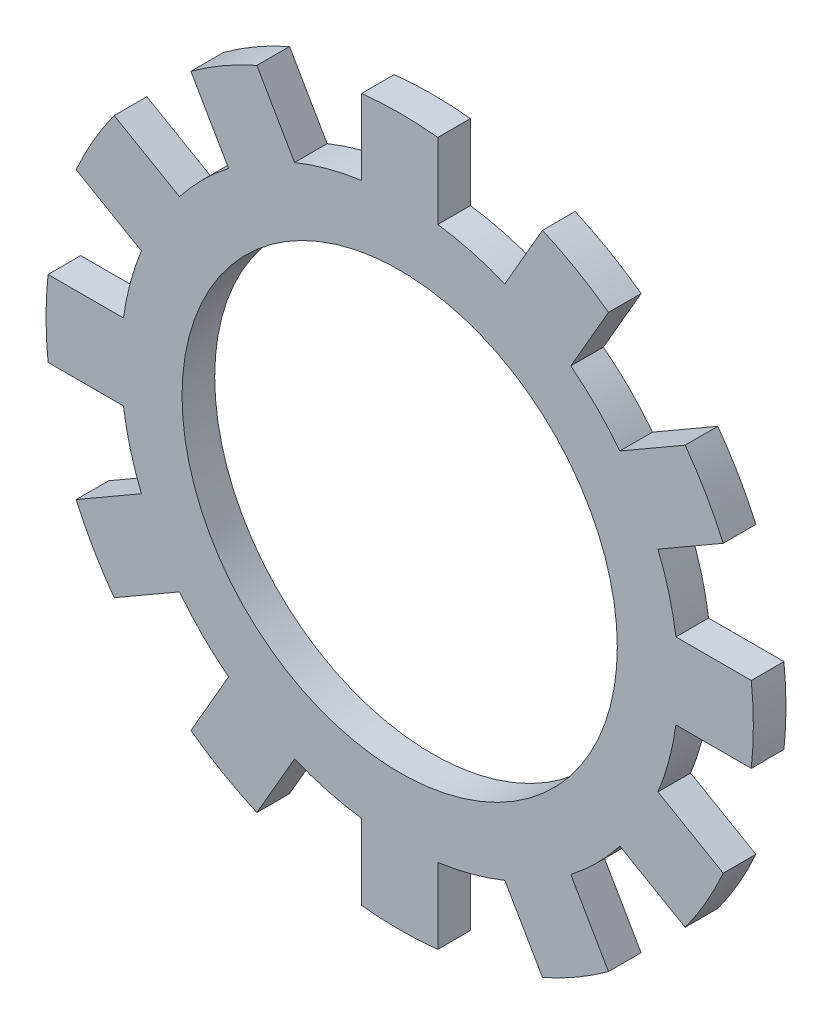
ISO-10303-21;
HEADER;
FILE_DESCRIPTION(('STEP AP214'),'2;1');
FILE_NAME('part.step','',(''),(''),'','','');
FILE_SCHEMA(('AUTOMOTIVE_DESIGN { 1 0 10303 214 1 1 1 1 }'));
ENDSEC;
DATA;
#1=APPLICATION_CONTEXT('core data for automotive mechanical design processes');
#2=APPLICATION_PROTOCOL_DEFINITION('international standard','automotive_design',2000,#1);
#3=PRODUCT_CONTEXT('',#1,'mechanical');
#4=PRODUCT('Part','Part','',(#3));
#5=PRODUCT_RELATED_PRODUCT_CATEGORY('part','',(#4));
#6=PRODUCT_DEFINITION_FORMATION('','',#4);
#7=PRODUCT_DEFINITION_CONTEXT('part definition',#1,'design');
#8=PRODUCT_DEFINITION('design','',#6,#7);
#9=PRODUCT_DEFINITION_SHAPE('','',#8);
#10=(LENGTH_UNIT() NAMED_UNIT(*) SI_UNIT(.MILLI.,.METRE.));
#11=(NAMED_UNIT(*) PLANE_ANGLE_UNIT() SI_UNIT($,.RADIAN.));
#12=(NAMED_UNIT(*) SI_UNIT($,.STERADIAN.) SOLID_ANGLE_UNIT());
#13=UNCERTAINTY_MEASURE_WITH_UNIT(LENGTH_MEASURE(1.E-05),#10,'distance_accuracy_value','');
#14=(GEOMETRIC_REPRESENTATION_CONTEXT(3) GLOBAL_UNCERTAINTY_ASSIGNED_CONTEXT((#13)) GLOBAL_UNIT_ASSIGNED_CONTEXT((#10,
#11,#12)) REPRESENTATION_CONTEXT('',''));
#15=CARTESIAN_POINT('',(0.,0.,0.));
#16=DIRECTION('',(0.,0.,1.));
#17=DIRECTION('',(1.,0.,0.));
#18=AXIS2_PLACEMENT_3D('',#15,#16,#17);
#19=CARTESIAN_POINT('',(0.,0.,0.6));
#20=DIRECTION('',(0.,0.,-1.));
#21=DIRECTION('',(-1.,0.,0.));
#22=AXIS2_PLACEMENT_3D('',#19,#20,#21);
#23=CYLINDRICAL_SURFACE('',#22,10.25);
#24=CARTESIAN_POINT('',(0.,0.,-0.6));
#25=DIRECTION('',(0.,0.,1.));
#26=DIRECTION('',(1.,0.,0.));
#27=AXIS2_PLACEMENT_3D('',#24,#25,#26);
#28=CIRCLE('',#27,10.25);
#29=CARTESIAN_POINT('',(8.09357009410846,6.28940562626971,-0.6));
#30=VERTEX_POINT('',#29);
#31=CARTESIAN_POINT('',(6.28940562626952,8.09357009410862,-0.6));
#32=VERTEX_POINT('',#31);
#33=EDGE_CURVE('E361',#30,#32,#28,.T.);
#34=ORIENTED_EDGE('',*,*,#33,.T.);
#35=DIRECTION('',(0.,0.,-1.));
#36=VECTOR('',#35,1.);
#37=CARTESIAN_POINT('',(6.28940562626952,8.09357009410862,0.6));
#38=LINE('',#37,#36);
#39=CARTESIAN_POINT('',(6.28940562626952,8.09357009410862,0.6));
#40=VERTEX_POINT('',#39);
#41=EDGE_CURVE('E352',#40,#32,#38,.T.);
#42=ORIENTED_EDGE('',*,*,#41,.F.);
#43=CARTESIAN_POINT('',(0.,0.,0.6));
#44=DIRECTION('',(0.,0.,1.));
#45=DIRECTION('',(1.,0.,0.));
#46=AXIS2_PLACEMENT_3D('',#43,#44,#45);
#47=CIRCLE('',#46,10.25);
#48=CARTESIAN_POINT('',(8.09357009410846,6.28940562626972,0.6));
#49=VERTEX_POINT('',#48);
#50=EDGE_CURVE('E64',#49,#40,#47,.T.);
#51=ORIENTED_EDGE('',*,*,#50,.F.);
#52=DIRECTION('',(0.,0.,-1.));
#53=VECTOR('',#52,1.);
#54=CARTESIAN_POINT('',(8.09357009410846,6.28940562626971,0.6));
#55=LINE('',#54,#53);
#56=EDGE_CURVE('E627',#49,#30,#55,.T.);
#57=ORIENTED_EDGE('',*,*,#56,.T.);
#58=EDGE_LOOP('',(#34,#42,#51,#57));
#59=FACE_BOUND('',#58,.T.);
#60=ADVANCED_FACE('F39',(#59),#23,.T.);
#61=DIRECTION('',(0.,0.,-1.));
#62=VECTOR('',#61,1.);
#63=CARTESIAN_POINT('',(3.86453449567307,9.49357009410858,0.6));
#64=LINE('',#63,#62);
#65=CARTESIAN_POINT('',(3.86453449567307,9.49357009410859,0.6));
#66=VERTEX_POINT('',#65);
#67=CARTESIAN_POINT('',(3.86453449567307,9.49357009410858,-0.6));
#68=VERTEX_POINT('',#67);
#69=EDGE_CURVE('E646',#66,#68,#64,.T.);
#70=ORIENTED_EDGE('',*,*,#69,.T.);
#71=CARTESIAN_POINT('',(1.4,10.1539401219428,-0.6));
#72=VERTEX_POINT('',#71);
#73=EDGE_CURVE('E388',#68,#72,#28,.T.);
#74=ORIENTED_EDGE('',*,*,#73,.T.);
#75=DIRECTION('',(0.,0.,-1.));
#76=VECTOR('',#75,1.);
#77=CARTESIAN_POINT('',(1.4,10.1539401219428,0.6));
#78=LINE('',#77,#76);
#79=CARTESIAN_POINT('',(1.4,10.1539401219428,0.6));
#80=VERTEX_POINT('',#79);
#81=EDGE_CURVE('E405',#80,#72,#78,.T.);
#82=ORIENTED_EDGE('',*,*,#81,.F.);
#83=EDGE_CURVE('E50',#66,#80,#47,.T.);
#84=ORIENTED_EDGE('',*,*,#83,.F.);
#85=EDGE_LOOP('',(#70,#74,#82,#84));
#86=FACE_BOUND('',#85,.T.);
#87=ADVANCED_FACE('F816',(#86),#23,.T.);
#88=CARTESIAN_POINT('',(10.1539401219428,1.40000000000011,-0.6));
#89=VERTEX_POINT('',#88);
#90=CARTESIAN_POINT('',(9.49357009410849,3.8645344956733,-0.6));
#91=VERTEX_POINT('',#90);
#92=EDGE_CURVE('E907',#89,#91,#28,.T.);
#93=ORIENTED_EDGE('',*,*,#92,.T.);
#94=DIRECTION('',(0.,0.,-1.));
#95=VECTOR('',#94,1.);
#96=CARTESIAN_POINT('',(9.49357009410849,3.8645344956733,0.6));
#97=LINE('',#96,#95);
#98=CARTESIAN_POINT('',(9.49357009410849,3.8645344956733,0.6));
#99=VERTEX_POINT('',#98);
#100=EDGE_CURVE('E785',#99,#91,#97,.T.);
#101=ORIENTED_EDGE('',*,*,#100,.F.);
#102=CARTESIAN_POINT('',(10.1539401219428,1.40000000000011,0.6));
#103=VERTEX_POINT('',#102);
#104=EDGE_CURVE('E371',#103,#99,#47,.T.);
#105=ORIENTED_EDGE('',*,*,#104,.F.);
#106=DIRECTION('',(0.,0.,-1.));
#107=VECTOR('',#106,1.);
#108=CARTESIAN_POINT('',(10.1539401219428,1.40000000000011,0.6));
#109=LINE('',#108,#107);
#110=EDGE_CURVE('E605',#103,#89,#109,.T.);
#111=ORIENTED_EDGE('',*,*,#110,.T.);
#112=EDGE_LOOP('',(#93,#101,#105,#111));
#113=FACE_BOUND('',#112,.T.);
#114=ADVANCED_FACE('F905',(#113),#23,.T.);
#115=CARTESIAN_POINT('',(9.49357009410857,-3.8645344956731,-0.6));
#116=VERTEX_POINT('',#115);
#117=CARTESIAN_POINT('',(10.1539401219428,-1.39999999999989,-0.6));
#118=VERTEX_POINT('',#117);
#119=EDGE_CURVE('E888',#116,#118,#28,.T.);
#120=ORIENTED_EDGE('',*,*,#119,.T.);
#121=DIRECTION('',(0.,0.,-1.));
#122=VECTOR('',#121,1.);
#123=CARTESIAN_POINT('',(10.1539401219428,-1.39999999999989,0.6));
#124=LINE('',#123,#122);
#125=CARTESIAN_POINT('',(10.1539401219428,-1.39999999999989,0.6));
#126=VERTEX_POINT('',#125);
#127=EDGE_CURVE('E771',#126,#118,#124,.T.);
#128=ORIENTED_EDGE('',*,*,#127,.F.);
#129=CARTESIAN_POINT('',(9.49357009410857,-3.8645344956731,0.6));
#130=VERTEX_POINT('',#129);
#131=EDGE_CURVE('E376',#130,#126,#47,.T.);
#132=ORIENTED_EDGE('',*,*,#131,.F.);
#133=DIRECTION('',(0.,0.,-1.));
#134=VECTOR('',#133,1.);
#135=CARTESIAN_POINT('',(9.49357009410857,-3.8645344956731,0.6));
#136=LINE('',#135,#134);
#137=EDGE_CURVE('E584',#130,#116,#136,.T.);
#138=ORIENTED_EDGE('',*,*,#137,.T.);
#139=EDGE_LOOP('',(#120,#128,#132,#138));
#140=FACE_BOUND('',#139,.T.);
#141=ADVANCED_FACE('F887',(#140),#23,.T.);
#142=CARTESIAN_POINT('',(6.28940562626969,-8.09357009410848,-0.6));
#143=VERTEX_POINT('',#142);
#144=CARTESIAN_POINT('',(8.09357009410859,-6.28940562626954,-0.6));
#145=VERTEX_POINT('',#144);
#146=EDGE_CURVE('E965',#143,#145,#28,.T.);
#147=ORIENTED_EDGE('',*,*,#146,.T.);
#148=DIRECTION('',(0.,0.,-1.));
#149=VECTOR('',#148,1.);
#150=CARTESIAN_POINT('',(8.09357009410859,-6.28940562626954,0.6));
#151=LINE('',#150,#149);
#152=CARTESIAN_POINT('',(8.09357009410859,-6.28940562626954,0.6));
#153=VERTEX_POINT('',#152);
#154=EDGE_CURVE('E757',#153,#145,#151,.T.);
#155=ORIENTED_EDGE('',*,*,#154,.F.);
#156=CARTESIAN_POINT('',(6.28940562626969,-8.09357009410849,0.6));
#157=VERTEX_POINT('',#156);
#158=EDGE_CURVE('E873',#157,#153,#47,.T.);
#159=ORIENTED_EDGE('',*,*,#158,.F.);
#160=DIRECTION('',(0.,0.,-1.));
#161=VECTOR('',#160,1.);
#162=CARTESIAN_POINT('',(6.28940562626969,-8.09357009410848,0.6));
#163=LINE('',#162,#161);
#164=EDGE_CURVE('E562',#157,#143,#163,.T.);
#165=ORIENTED_EDGE('',*,*,#164,.T.);
#166=EDGE_LOOP('',(#147,#155,#159,#165));
#167=FACE_BOUND('',#166,.T.);
#168=ADVANCED_FACE('F974',(#167),#23,.T.);
#169=CARTESIAN_POINT('',(1.4,-10.1539401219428,-0.6));
#170=VERTEX_POINT('',#169);
#171=CARTESIAN_POINT('',(3.86453449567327,-9.4935700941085,-0.6));
#172=VERTEX_POINT('',#171);
#173=EDGE_CURVE('E961',#170,#172,#28,.T.);
#174=ORIENTED_EDGE('',*,*,#173,.T.);
#175=DIRECTION('',(0.,0.,-1.));
#176=VECTOR('',#175,1.);
#177=CARTESIAN_POINT('',(3.86453449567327,-9.4935700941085,0.6));
#178=LINE('',#177,#176);
#179=CARTESIAN_POINT('',(3.86453449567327,-9.4935700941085,0.6));
#180=VERTEX_POINT('',#179);
#181=EDGE_CURVE('E744',#180,#172,#178,.T.);
#182=ORIENTED_EDGE('',*,*,#181,.F.);
#183=CARTESIAN_POINT('',(1.4,-10.1539401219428,0.6));
#184=VERTEX_POINT('',#183);
#185=EDGE_CURVE('E868',#184,#180,#47,.T.);
#186=ORIENTED_EDGE('',*,*,#185,.F.);
#187=DIRECTION('',(0.,0.,-1.));
#188=VECTOR('',#187,1.);
#189=CARTESIAN_POINT('',(1.4,-10.1539401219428,0.6));
#190=LINE('',#189,#188);
#191=EDGE_CURVE('E540',#184,#170,#190,.T.);
#192=ORIENTED_EDGE('',*,*,#191,.T.);
#193=EDGE_LOOP('',(#174,#182,#186,#192));
#194=FACE_BOUND('',#193,.T.);
#195=ADVANCED_FACE('F1402',(#194),#23,.T.);
#196=CARTESIAN_POINT('',(-3.86453449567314,-9.49357009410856,-0.6));
#197=VERTEX_POINT('',#196);
#198=CARTESIAN_POINT('',(-1.4,-10.1539401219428,-0.6));
#199=VERTEX_POINT('',#198);
#200=EDGE_CURVE('E957',#197,#199,#28,.T.);
#201=ORIENTED_EDGE('',*,*,#200,.T.);
#202=DIRECTION('',(0.,0.,-1.));
#203=VECTOR('',#202,1.);
#204=CARTESIAN_POINT('',(-1.4,-10.1539401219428,0.6));
#205=LINE('',#204,#203);
#206=CARTESIAN_POINT('',(-1.4,-10.1539401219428,0.6));
#207=VERTEX_POINT('',#206);
#208=EDGE_CURVE('E730',#207,#199,#205,.T.);
#209=ORIENTED_EDGE('',*,*,#208,.F.);
#210=CARTESIAN_POINT('',(-3.86453449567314,-9.49357009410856,0.6));
#211=VERTEX_POINT('',#210);
#212=EDGE_CURVE('E863',#211,#207,#47,.T.);
#213=ORIENTED_EDGE('',*,*,#212,.F.);
#214=DIRECTION('',(0.,0.,-1.));
#215=VECTOR('',#214,1.);
#216=CARTESIAN_POINT('',(-3.86453449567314,-9.49357009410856,0.6));
#217=LINE('',#216,#215);
#218=EDGE_CURVE('E518',#211,#197,#217,.T.);
#219=ORIENTED_EDGE('',*,*,#218,.T.);
#220=EDGE_LOOP('',(#201,#209,#213,#219));
#221=FACE_BOUND('',#220,.T.);
#222=ADVANCED_FACE('F1394',(#221),#23,.T.);
#223=CARTESIAN_POINT('',(-8.09357009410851,-6.28940562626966,-0.6));
#224=VERTEX_POINT('',#223);
#225=CARTESIAN_POINT('',(-6.28940562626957,-8.09357009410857,-0.6));
#226=VERTEX_POINT('',#225);
#227=EDGE_CURVE('E952',#224,#226,#28,.T.);
#228=ORIENTED_EDGE('',*,*,#227,.T.);
#229=DIRECTION('',(0.,0.,-1.));
#230=VECTOR('',#229,1.);
#231=CARTESIAN_POINT('',(-6.28940562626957,-8.09357009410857,0.6));
#232=LINE('',#231,#230);
#233=CARTESIAN_POINT('',(-6.28940562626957,-8.09357009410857,0.6));
#234=VERTEX_POINT('',#233);
#235=EDGE_CURVE('E716',#234,#226,#232,.T.);
#236=ORIENTED_EDGE('',*,*,#235,.F.);
#237=CARTESIAN_POINT('',(-8.09357009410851,-6.28940562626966,0.6));
#238=VERTEX_POINT('',#237);
#239=EDGE_CURVE('E859',#238,#234,#47,.T.);
#240=ORIENTED_EDGE('',*,*,#239,.F.);
#241=DIRECTION('',(0.,0.,-1.));
#242=VECTOR('',#241,1.);
#243=CARTESIAN_POINT('',(-8.09357009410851,-6.28940562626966,0.6));
#244=LINE('',#243,#242);
#245=EDGE_CURVE('E496',#238,#224,#244,.T.);
#246=ORIENTED_EDGE('',*,*,#245,.T.);
#247=EDGE_LOOP('',(#228,#236,#240,#246));
#248=FACE_BOUND('',#247,.T.);
#249=ADVANCED_FACE('F1386',(#248),#23,.T.);
#250=CARTESIAN_POINT('',(-10.1539401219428,-1.40000000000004,-0.6));
#251=VERTEX_POINT('',#250);
#252=CARTESIAN_POINT('',(-9.49357009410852,-3.86453449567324,-0.6));
#253=VERTEX_POINT('',#252);
#254=EDGE_CURVE('E948',#251,#253,#28,.T.);
#255=ORIENTED_EDGE('',*,*,#254,.T.);
#256=DIRECTION('',(0.,0.,-1.));
#257=VECTOR('',#256,1.);
#258=CARTESIAN_POINT('',(-9.49357009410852,-3.86453449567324,0.6));
#259=LINE('',#258,#257);
#260=CARTESIAN_POINT('',(-9.49357009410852,-3.86453449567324,0.6));
#261=VERTEX_POINT('',#260);
#262=EDGE_CURVE('E702',#261,#253,#259,.T.);
#263=ORIENTED_EDGE('',*,*,#262,.F.);
#264=CARTESIAN_POINT('',(-10.1539401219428,-1.40000000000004,0.6));
#265=VERTEX_POINT('',#264);
#266=EDGE_CURVE('E855',#265,#261,#47,.T.);
#267=ORIENTED_EDGE('',*,*,#266,.F.);
#268=DIRECTION('',(0.,0.,-1.));
#269=VECTOR('',#268,1.);
#270=CARTESIAN_POINT('',(-10.1539401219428,-1.40000000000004,0.6));
#271=LINE('',#270,#269);
#272=EDGE_CURVE('E474',#265,#251,#271,.T.);
#273=ORIENTED_EDGE('',*,*,#272,.T.);
#274=EDGE_LOOP('',(#255,#263,#267,#273));
#275=FACE_BOUND('',#274,.T.);
#276=ADVANCED_FACE('F940',(#275),#23,.T.);
#277=CARTESIAN_POINT('',(-9.49357009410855,3.86453449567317,-0.6));
#278=VERTEX_POINT('',#277);
#279=CARTESIAN_POINT('',(-10.1539401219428,1.39999999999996,-0.6));
#280=VERTEX_POINT('',#279);
#281=EDGE_CURVE('E944',#278,#280,#28,.T.);
#282=ORIENTED_EDGE('',*,*,#281,.T.);
#283=DIRECTION('',(0.,0.,-1.));
#284=VECTOR('',#283,1.);
#285=CARTESIAN_POINT('',(-10.1539401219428,1.39999999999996,0.6));
#286=LINE('',#285,#284);
#287=CARTESIAN_POINT('',(-10.1539401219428,1.39999999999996,0.6));
#288=VERTEX_POINT('',#287);
#289=EDGE_CURVE('E688',#288,#280,#286,.T.);
#290=ORIENTED_EDGE('',*,*,#289,.F.);
#291=CARTESIAN_POINT('',(-9.49357009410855,3.86453449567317,0.6));
#292=VERTEX_POINT('',#291);
#293=EDGE_CURVE('E851',#292,#288,#47,.T.);
#294=ORIENTED_EDGE('',*,*,#293,.F.);
#295=DIRECTION('',(0.,0.,-1.));
#296=VECTOR('',#295,1.);
#297=CARTESIAN_POINT('',(-9.49357009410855,3.86453449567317,0.6));
#298=LINE('',#297,#296);
#299=EDGE_CURVE('E452',#292,#278,#298,.T.);
#300=ORIENTED_EDGE('',*,*,#299,.T.);
#301=EDGE_LOOP('',(#282,#290,#294,#300));
#302=FACE_BOUND('',#301,.T.);
#303=ADVANCED_FACE('F936',(#302),#23,.T.);
#304=CARTESIAN_POINT('',(-6.28940562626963,8.09357009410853,-0.6));
#305=VERTEX_POINT('',#304);
#306=CARTESIAN_POINT('',(-8.09357009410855,6.2894056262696,-0.6));
#307=VERTEX_POINT('',#306);
#308=EDGE_CURVE('E943',#305,#307,#28,.T.);
#309=ORIENTED_EDGE('',*,*,#308,.T.);
#310=DIRECTION('',(0.,0.,-1.));
#311=VECTOR('',#310,1.);
#312=CARTESIAN_POINT('',(-8.09357009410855,6.2894056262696,0.6));
#313=LINE('',#312,#311);
#314=CARTESIAN_POINT('',(-8.09357009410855,6.2894056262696,0.6));
#315=VERTEX_POINT('',#314);
#316=EDGE_CURVE('E674',#315,#307,#313,.T.);
#317=ORIENTED_EDGE('',*,*,#316,.F.);
#318=CARTESIAN_POINT('',(-6.28940562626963,8.09357009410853,0.6));
#319=VERTEX_POINT('',#318);
#320=EDGE_CURVE('E49',#319,#315,#47,.T.);
#321=ORIENTED_EDGE('',*,*,#320,.F.);
#322=DIRECTION('',(0.,0.,-1.));
#323=VECTOR('',#322,1.);
#324=CARTESIAN_POINT('',(-6.28940562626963,8.09357009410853,0.6));
#325=LINE('',#324,#323);
#326=EDGE_CURVE('E430',#319,#305,#325,.T.);
#327=ORIENTED_EDGE('',*,*,#326,.T.);
#328=EDGE_LOOP('',(#309,#317,#321,#327));
#329=FACE_BOUND('',#328,.T.);
#330=ADVANCED_FACE('F930',(#329),#23,.T.);
#331=CARTESIAN_POINT('',(-1.4,10.1539401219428,-0.6));
#332=VERTEX_POINT('',#331);
#333=CARTESIAN_POINT('',(-3.8645344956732,9.49357009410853,-0.6));
#334=VERTEX_POINT('',#333);
#335=EDGE_CURVE('E43',#332,#334,#28,.T.);
#336=ORIENTED_EDGE('',*,*,#335,.T.);
#337=DIRECTION('',(0.,0.,-1.));
#338=VECTOR('',#337,1.);
#339=CARTESIAN_POINT('',(-3.8645344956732,9.49357009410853,0.6));
#340=LINE('',#339,#338);
#341=CARTESIAN_POINT('',(-3.8645344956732,9.49357009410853,0.6));
#342=VERTEX_POINT('',#341);
#343=EDGE_CURVE('E658',#342,#334,#340,.T.);
#344=ORIENTED_EDGE('',*,*,#343,.F.);
#345=CARTESIAN_POINT('',(-1.4,10.1539401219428,0.6));
#346=VERTEX_POINT('',#345);
#347=EDGE_CURVE('E11',#346,#342,#47,.T.);
#348=ORIENTED_EDGE('',*,*,#347,.F.);
#349=DIRECTION('',(0.,0.,-1.));
#350=VECTOR('',#349,1.);
#351=CARTESIAN_POINT('',(-1.4,10.1539401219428,0.6));
#352=LINE('',#351,#350);
#353=EDGE_CURVE('E392',#346,#332,#352,.T.);
#354=ORIENTED_EDGE('',*,*,#353,.T.);
#355=EDGE_LOOP('',(#336,#344,#348,#354));
#356=FACE_BOUND('',#355,.T.);
#357=ADVANCED_FACE('F41',(#356),#23,.T.);
#358=CARTESIAN_POINT('',(0.,0.,0.6));
#359=DIRECTION('',(0.,0.,1.));
#360=DIRECTION('',(1.,0.,0.));
#361=AXIS2_PLACEMENT_3D('',#358,#359,#360);
#362=PLANE('',#361);
#363=ORIENTED_EDGE('',*,*,#347,.T.);
#364=DIRECTION('',(0.500000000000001,-0.866025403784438,0.));
#365=VECTOR('',#364,1.);
#366=CARTESIAN_POINT('',(-5.2497622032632,11.8928548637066,0.6));
#367=LINE('',#366,#365);
#368=CARTESIAN_POINT('',(-5.2497622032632,11.8928548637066,0.6));
#369=VERTEX_POINT('',#368);
#370=EDGE_CURVE('E669',#369,#342,#367,.T.);
#371=ORIENTED_EDGE('',*,*,#370,.F.);
#372=CARTESIAN_POINT('',(0.,0.,0.6));
#373=DIRECTION('',(0.,0.,1.));
#374=DIRECTION('',(0.866025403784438,0.500000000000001,0.));
#375=AXIS2_PLACEMENT_3D('',#372,#373,#374);
#376=CIRCLE('',#375,13.);
#377=CARTESIAN_POINT('',(-7.67463333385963,10.4928548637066,0.6));
#378=VERTEX_POINT('',#377);
#379=EDGE_CURVE('E439',#369,#378,#376,.T.);
#380=ORIENTED_EDGE('',*,*,#379,.T.);
#381=DIRECTION('',(0.500000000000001,-0.866025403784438,0.));
#382=VECTOR('',#381,1.);
#383=CARTESIAN_POINT('',(-7.67463333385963,10.4928548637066,0.6));
#384=LINE('',#383,#382);
#385=EDGE_CURVE('E434',#378,#319,#384,.T.);
#386=ORIENTED_EDGE('',*,*,#385,.T.);
#387=ORIENTED_EDGE('',*,*,#320,.T.);
#388=DIRECTION('',(0.86602540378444,-0.499999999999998,0.));
#389=VECTOR('',#388,1.);
#390=CARTESIAN_POINT('',(-10.4928548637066,7.67463333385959,0.6));
#391=LINE('',#390,#389);
#392=CARTESIAN_POINT('',(-10.4928548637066,7.67463333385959,0.6));
#393=VERTEX_POINT('',#392);
#394=EDGE_CURVE('E683',#393,#315,#391,.T.);
#395=ORIENTED_EDGE('',*,*,#394,.F.);
#396=CARTESIAN_POINT('',(0.,0.,0.6));
#397=DIRECTION('',(0.,0.,1.));
#398=DIRECTION('',(0.499999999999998,0.86602540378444,0.));
#399=AXIS2_PLACEMENT_3D('',#396,#397,#398);
#400=CIRCLE('',#399,13.);
#401=CARTESIAN_POINT('',(-11.8928548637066,5.24976220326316,0.6));
#402=VERTEX_POINT('',#401);
#403=EDGE_CURVE('E461',#393,#402,#400,.T.);
#404=ORIENTED_EDGE('',*,*,#403,.T.);
#405=DIRECTION('',(0.86602540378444,-0.499999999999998,0.));
#406=VECTOR('',#405,1.);
#407=CARTESIAN_POINT('',(-11.8928548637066,5.24976220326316,0.6));
#408=LINE('',#407,#406);
#409=EDGE_CURVE('E456',#402,#292,#408,.T.);
#410=ORIENTED_EDGE('',*,*,#409,.T.);
#411=ORIENTED_EDGE('',*,*,#293,.T.);
#412=DIRECTION('',(1.,0.,0.));
#413=VECTOR('',#412,1.);
#414=CARTESIAN_POINT('',(-12.9243955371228,1.39999999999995,0.6));
#415=LINE('',#414,#413);
#416=CARTESIAN_POINT('',(-12.9243955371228,1.39999999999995,0.6));
#417=VERTEX_POINT('',#416);
#418=EDGE_CURVE('E697',#417,#288,#415,.T.);
#419=ORIENTED_EDGE('',*,*,#418,.F.);
#420=CARTESIAN_POINT('',(0.,0.,0.6));
#421=DIRECTION('',(0.,0.,1.));
#422=DIRECTION('',(0.,1.,0.));
#423=AXIS2_PLACEMENT_3D('',#420,#421,#422);
#424=CIRCLE('',#423,13.);
#425=CARTESIAN_POINT('',(-12.9243955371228,-1.40000000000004,0.6));
#426=VERTEX_POINT('',#425);
#427=EDGE_CURVE('E483',#417,#426,#424,.T.);
#428=ORIENTED_EDGE('',*,*,#427,.T.);
#429=DIRECTION('',(1.,0.,0.));
#430=VECTOR('',#429,1.);
#431=CARTESIAN_POINT('',(-12.9243955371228,-1.40000000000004,0.6));
#432=LINE('',#431,#430);
#433=EDGE_CURVE('E478',#426,#265,#432,.T.);
#434=ORIENTED_EDGE('',*,*,#433,.T.);
#435=ORIENTED_EDGE('',*,*,#266,.T.);
#436=DIRECTION('',(0.866025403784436,0.500000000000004,0.));
#437=VECTOR('',#436,1.);
#438=CARTESIAN_POINT('',(-11.8928548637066,-5.24976220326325,0.6));
#439=LINE('',#438,#437);
#440=CARTESIAN_POINT('',(-11.8928548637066,-5.24976220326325,0.6));
#441=VERTEX_POINT('',#440);
#442=EDGE_CURVE('E711',#441,#261,#439,.T.);
#443=ORIENTED_EDGE('',*,*,#442,.F.);
#444=CARTESIAN_POINT('',(0.,0.,0.6));
#445=DIRECTION('',(0.,0.,1.));
#446=DIRECTION('',(-0.500000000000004,0.866025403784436,0.));
#447=AXIS2_PLACEMENT_3D('',#444,#445,#446);
#448=CIRCLE('',#447,13.);
#449=CARTESIAN_POINT('',(-10.4928548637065,-7.67463333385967,0.6));
#450=VERTEX_POINT('',#449);
#451=EDGE_CURVE('E505',#441,#450,#448,.T.);
#452=ORIENTED_EDGE('',*,*,#451,.T.);
#453=DIRECTION('',(0.866025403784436,0.500000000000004,0.));
#454=VECTOR('',#453,1.);
#455=CARTESIAN_POINT('',(-10.4928548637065,-7.67463333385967,0.6));
#456=LINE('',#455,#454);
#457=EDGE_CURVE('E500',#450,#238,#456,.T.);
#458=ORIENTED_EDGE('',*,*,#457,.T.);
#459=ORIENTED_EDGE('',*,*,#239,.T.);
#460=DIRECTION('',(0.499999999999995,0.866025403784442,0.));
#461=VECTOR('',#460,1.);
#462=CARTESIAN_POINT('',(-7.67463333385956,-10.4928548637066,0.6));
#463=LINE('',#462,#461);
#464=CARTESIAN_POINT('',(-7.67463333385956,-10.4928548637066,0.6));
#465=VERTEX_POINT('',#464);
#466=EDGE_CURVE('E725',#465,#234,#463,.T.);
#467=ORIENTED_EDGE('',*,*,#466,.F.);
#468=CARTESIAN_POINT('',(0.,0.,0.6));
#469=DIRECTION('',(0.,0.,1.));
#470=DIRECTION('',(-0.866025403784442,0.499999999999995,0.));
#471=AXIS2_PLACEMENT_3D('',#468,#469,#470);
#472=CIRCLE('',#471,13.);
#473=CARTESIAN_POINT('',(-5.24976220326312,-11.8928548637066,0.6));
#474=VERTEX_POINT('',#473);
#475=EDGE_CURVE('E527',#465,#474,#472,.T.);
#476=ORIENTED_EDGE('',*,*,#475,.T.);
#477=DIRECTION('',(0.499999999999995,0.866025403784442,0.));
#478=VECTOR('',#477,1.);
#479=CARTESIAN_POINT('',(-5.24976220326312,-11.8928548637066,0.6));
#480=LINE('',#479,#478);
#481=EDGE_CURVE('E522',#474,#211,#480,.T.);
#482=ORIENTED_EDGE('',*,*,#481,.T.);
#483=ORIENTED_EDGE('',*,*,#212,.T.);
#484=DIRECTION('',(0.,1.,0.));
#485=VECTOR('',#484,1.);
#486=CARTESIAN_POINT('',(-1.4,-12.9243955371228,0.6));
#487=LINE('',#486,#485);
#488=CARTESIAN_POINT('',(-1.4,-12.9243955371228,0.6));
#489=VERTEX_POINT('',#488);
#490=EDGE_CURVE('E739',#489,#207,#487,.T.);
#491=ORIENTED_EDGE('',*,*,#490,.F.);
#492=CARTESIAN_POINT('',(0.,0.,0.6));
#493=DIRECTION('',(0.,0.,1.));
#494=DIRECTION('',(-1.,0.,0.));
#495=AXIS2_PLACEMENT_3D('',#492,#493,#494);
#496=CIRCLE('',#495,13.);
#497=CARTESIAN_POINT('',(1.4,-12.9243955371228,0.6));
#498=VERTEX_POINT('',#497);
#499=EDGE_CURVE('E549',#489,#498,#496,.T.);
#500=ORIENTED_EDGE('',*,*,#499,.T.);
#501=DIRECTION('',(0.,1.,0.));
#502=VECTOR('',#501,1.);
#503=CARTESIAN_POINT('',(1.4,-12.9243955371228,0.6));
#504=LINE('',#503,#502);
#505=EDGE_CURVE('E544',#498,#184,#504,.T.);
#506=ORIENTED_EDGE('',*,*,#505,.T.);
#507=ORIENTED_EDGE('',*,*,#185,.T.);
#508=DIRECTION('',(-0.500000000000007,0.866025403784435,0.));
#509=VECTOR('',#508,1.);
#510=CARTESIAN_POINT('',(5.24976220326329,-11.8928548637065,0.6));
#511=LINE('',#510,#509);
#512=CARTESIAN_POINT('',(5.24976220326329,-11.8928548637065,0.6));
#513=VERTEX_POINT('',#512);
#514=EDGE_CURVE('E752',#513,#180,#511,.T.);
#515=ORIENTED_EDGE('',*,*,#514,.F.);
#516=CARTESIAN_POINT('',(0.,0.,0.6));
#517=DIRECTION('',(0.,0.,1.));
#518=DIRECTION('',(-0.866025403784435,-0.500000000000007,0.));
#519=AXIS2_PLACEMENT_3D('',#516,#517,#518);
#520=CIRCLE('',#519,13.);
#521=CARTESIAN_POINT('',(7.6746333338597,-10.4928548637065,0.6));
#522=VERTEX_POINT('',#521);
#523=EDGE_CURVE('E571',#513,#522,#520,.T.);
#524=ORIENTED_EDGE('',*,*,#523,.T.);
#525=DIRECTION('',(-0.500000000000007,0.866025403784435,0.));
#526=VECTOR('',#525,1.);
#527=CARTESIAN_POINT('',(7.67463333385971,-10.4928548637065,0.6));
#528=LINE('',#527,#526);
#529=EDGE_CURVE('E566',#522,#157,#528,.T.);
#530=ORIENTED_EDGE('',*,*,#529,.T.);
#531=ORIENTED_EDGE('',*,*,#158,.T.);
#532=DIRECTION('',(-0.866025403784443,0.499999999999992,0.));
#533=VECTOR('',#532,1.);
#534=CARTESIAN_POINT('',(10.4928548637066,-7.67463333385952,0.6));
#535=LINE('',#534,#533);
#536=CARTESIAN_POINT('',(10.4928548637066,-7.67463333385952,0.6));
#537=VERTEX_POINT('',#536);
#538=EDGE_CURVE('E766',#537,#153,#535,.T.);
#539=ORIENTED_EDGE('',*,*,#538,.F.);
#540=CARTESIAN_POINT('',(0.,0.,0.6));
#541=DIRECTION('',(0.,0.,1.));
#542=DIRECTION('',(-0.499999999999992,-0.866025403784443,0.));
#543=AXIS2_PLACEMENT_3D('',#540,#541,#542);
#544=CIRCLE('',#543,13.);
#545=CARTESIAN_POINT('',(11.8928548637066,-5.24976220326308,0.6));
#546=VERTEX_POINT('',#545);
#547=EDGE_CURVE('E593',#537,#546,#544,.T.);
#548=ORIENTED_EDGE('',*,*,#547,.T.);
#549=DIRECTION('',(-0.866025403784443,0.499999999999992,0.));
#550=VECTOR('',#549,1.);
#551=CARTESIAN_POINT('',(11.8928548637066,-5.24976220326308,0.6));
#552=LINE('',#551,#550);
#553=EDGE_CURVE('E588',#546,#130,#552,.T.);
#554=ORIENTED_EDGE('',*,*,#553,.T.);
#555=ORIENTED_EDGE('',*,*,#131,.T.);
#556=DIRECTION('',(-1.,0.,0.));
#557=VECTOR('',#556,1.);
#558=CARTESIAN_POINT('',(12.9243955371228,-1.39999999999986,0.6));
#559=LINE('',#558,#557);
#560=CARTESIAN_POINT('',(12.9243955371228,-1.39999999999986,0.6));
#561=VERTEX_POINT('',#560);
#562=EDGE_CURVE('E780',#561,#126,#559,.T.);
#563=ORIENTED_EDGE('',*,*,#562,.F.);
#564=CARTESIAN_POINT('',(0.,0.,0.6));
#565=DIRECTION('',(0.,0.,1.));
#566=DIRECTION('',(0.,-1.,0.));
#567=AXIS2_PLACEMENT_3D('',#564,#565,#566);
#568=CIRCLE('',#567,13.);
#569=CARTESIAN_POINT('',(12.9243955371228,1.40000000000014,0.6));
#570=VERTEX_POINT('',#569);
#571=EDGE_CURVE('E614',#561,#570,#568,.T.);
#572=ORIENTED_EDGE('',*,*,#571,.T.);
#573=DIRECTION('',(-1.,0.,0.));
#574=VECTOR('',#573,1.);
#575=CARTESIAN_POINT('',(12.9243955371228,1.40000000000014,0.6));
#576=LINE('',#575,#574);
#577=EDGE_CURVE('E609',#570,#103,#576,.T.);
#578=ORIENTED_EDGE('',*,*,#577,.T.);
#579=ORIENTED_EDGE('',*,*,#104,.T.);
#580=DIRECTION('',(-0.866025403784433,-0.50000000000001,0.));
#581=VECTOR('',#580,1.);
#582=CARTESIAN_POINT('',(11.8928548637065,5.24976220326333,0.6));
#583=LINE('',#582,#581);
#584=CARTESIAN_POINT('',(11.8928548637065,5.24976220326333,0.6));
#585=VERTEX_POINT('',#584);
#586=EDGE_CURVE('E794',#585,#99,#583,.T.);
#587=ORIENTED_EDGE('',*,*,#586,.F.);
#588=CARTESIAN_POINT('',(0.,0.,0.6));
#589=DIRECTION('',(0.,0.,1.));
#590=DIRECTION('',(0.50000000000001,-0.866025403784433,0.));
#591=AXIS2_PLACEMENT_3D('',#588,#589,#590);
#592=CIRCLE('',#591,13.);
#593=CARTESIAN_POINT('',(10.4928548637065,7.67463333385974,0.6));
#594=VERTEX_POINT('',#593);
#595=EDGE_CURVE('E634',#585,#594,#592,.T.);
#596=ORIENTED_EDGE('',*,*,#595,.T.);
#597=DIRECTION('',(-0.866025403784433,-0.50000000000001,0.));
#598=VECTOR('',#597,1.);
#599=CARTESIAN_POINT('',(10.4928548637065,7.67463333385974,0.6));
#600=LINE('',#599,#598);
#601=EDGE_CURVE('E368',#594,#49,#600,.T.);
#602=ORIENTED_EDGE('',*,*,#601,.T.);
#603=ORIENTED_EDGE('',*,*,#50,.T.);
#604=DIRECTION('',(-0.499999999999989,-0.866025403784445,0.));
#605=VECTOR('',#604,1.);
#606=CARTESIAN_POINT('',(7.67463333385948,10.4928548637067,0.6));
#607=LINE('',#606,#605);
#608=CARTESIAN_POINT('',(7.67463333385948,10.4928548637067,0.6));
#609=VERTEX_POINT('',#608);
#610=EDGE_CURVE('E349',#609,#40,#607,.T.);
#611=ORIENTED_EDGE('',*,*,#610,.F.);
#612=CARTESIAN_POINT('',(0.,0.,0.6));
#613=DIRECTION('',(0.,0.,1.));
#614=DIRECTION('',(0.866025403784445,-0.499999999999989,0.));
#615=AXIS2_PLACEMENT_3D('',#612,#613,#614);
#616=CIRCLE('',#615,13.);
#617=CARTESIAN_POINT('',(5.24976220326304,11.8928548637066,0.6));
#618=VERTEX_POINT('',#617);
#619=EDGE_CURVE('E654',#609,#618,#616,.T.);
#620=ORIENTED_EDGE('',*,*,#619,.T.);
#621=DIRECTION('',(-0.499999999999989,-0.866025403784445,0.));
#622=VECTOR('',#621,1.);
#623=CARTESIAN_POINT('',(5.24976220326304,11.8928548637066,0.6));
#624=LINE('',#623,#622);
#625=EDGE_CURVE('E649',#618,#66,#624,.T.);
#626=ORIENTED_EDGE('',*,*,#625,.T.);
#627=ORIENTED_EDGE('',*,*,#83,.T.);
#628=DIRECTION('',(0.,-1.,0.));
#629=VECTOR('',#628,1.);
#630=CARTESIAN_POINT('',(1.4,12.9243955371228,0.6));
#631=LINE('',#630,#629);
#632=CARTESIAN_POINT('',(1.4,12.9243955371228,0.6));
#633=VERTEX_POINT('',#632);
#634=EDGE_CURVE('E418',#633,#80,#631,.T.);
#635=ORIENTED_EDGE('',*,*,#634,.F.);
#636=CARTESIAN_POINT('',(0.,0.,0.6));
#637=DIRECTION('',(0.,0.,1.));
#638=DIRECTION('',(1.,0.,0.));
#639=AXIS2_PLACEMENT_3D('',#636,#637,#638);
#640=CIRCLE('',#639,13.);
#641=CARTESIAN_POINT('',(-1.4,12.9243955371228,0.6));
#642=VERTEX_POINT('',#641);
#643=EDGE_CURVE('E401',#633,#642,#640,.T.);
#644=ORIENTED_EDGE('',*,*,#643,.T.);
#645=DIRECTION('',(0.,-1.,0.));
#646=VECTOR('',#645,1.);
#647=CARTESIAN_POINT('',(-1.4,12.9243955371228,0.6));
#648=LINE('',#647,#646);
#649=EDGE_CURVE('E396',#642,#346,#648,.T.);
#650=ORIENTED_EDGE('',*,*,#649,.T.);
#651=EDGE_LOOP('',(#363,#371,#380,#386,#387,#395,#404,#410,#411,#419,#428,#434,#435,#443,#452,
#458,#459,#467,#476,#482,#483,#491,#500,#506,#507,#515,#524,#530,#531,#539,#548,#554,#555,#563,
#572,#578,#579,#587,#596,#602,#603,#611,#620,#626,#627,#635,#644,#650));
#652=FACE_BOUND('',#651,.T.);
#653=CARTESIAN_POINT('',(0.,0.,0.6));
#654=DIRECTION('',(0.,0.,1.));
#655=DIRECTION('',(1.,0.,0.));
#656=AXIS2_PLACEMENT_3D('',#653,#654,#655);
#657=CIRCLE('',#656,8.);
#658=CARTESIAN_POINT('',(8.,0.,0.6));
#659=VERTEX_POINT('',#658);
#660=EDGE_CURVE('E383',#659,#659,#657,.T.);
#661=ORIENTED_EDGE('',*,*,#660,.F.);
#662=EDGE_LOOP('',(#661));
#663=FACE_BOUND('',#662,.T.);
#664=ADVANCED_FACE('F365',(#652,#663),#362,.T.);
#665=CARTESIAN_POINT('',(0.,0.,-0.6));
#666=DIRECTION('',(0.,0.,1.));
#667=DIRECTION('',(1.,0.,0.));
#668=AXIS2_PLACEMENT_3D('',#665,#666,#667);
#669=PLANE('',#668);
#670=ORIENTED_EDGE('',*,*,#335,.F.);
#671=DIRECTION('',(0.,-1.,0.));
#672=VECTOR('',#671,1.);
#673=CARTESIAN_POINT('',(-1.4,12.9243955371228,-0.6));
#674=LINE('',#673,#672);
#675=CARTESIAN_POINT('',(-1.4,12.9243955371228,-0.6));
#676=VERTEX_POINT('',#675);
#677=EDGE_CURVE('E397',#676,#332,#674,.T.);
#678=ORIENTED_EDGE('',*,*,#677,.F.);
#679=CARTESIAN_POINT('',(0.,0.,-0.6));
#680=DIRECTION('',(0.,0.,1.));
#681=DIRECTION('',(1.,0.,0.));
#682=AXIS2_PLACEMENT_3D('',#679,#680,#681);
#683=CIRCLE('',#682,13.);
#684=CARTESIAN_POINT('',(1.4,12.9243955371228,-0.6));
#685=VERTEX_POINT('',#684);
#686=EDGE_CURVE('E402',#685,#676,#683,.T.);
#687=ORIENTED_EDGE('',*,*,#686,.F.);
#688=DIRECTION('',(0.,-1.,0.));
#689=VECTOR('',#688,1.);
#690=CARTESIAN_POINT('',(1.4,12.9243955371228,-0.6));
#691=LINE('',#690,#689);
#692=EDGE_CURVE('E419',#685,#72,#691,.T.);
#693=ORIENTED_EDGE('',*,*,#692,.T.);
#694=ORIENTED_EDGE('',*,*,#73,.F.);
#695=DIRECTION('',(-0.499999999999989,-0.866025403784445,0.));
#696=VECTOR('',#695,1.);
#697=CARTESIAN_POINT('',(5.24976220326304,11.8928548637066,-0.6));
#698=LINE('',#697,#696);
#699=CARTESIAN_POINT('',(5.24976220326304,11.8928548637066,-0.6));
#700=VERTEX_POINT('',#699);
#701=EDGE_CURVE('E650',#700,#68,#698,.T.);
#702=ORIENTED_EDGE('',*,*,#701,.F.);
#703=CARTESIAN_POINT('',(0.,0.,-0.6));
#704=DIRECTION('',(0.,0.,1.));
#705=DIRECTION('',(0.866025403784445,-0.499999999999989,0.));
#706=AXIS2_PLACEMENT_3D('',#703,#704,#705);
#707=CIRCLE('',#706,13.);
#708=CARTESIAN_POINT('',(7.67463333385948,10.4928548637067,-0.6));
#709=VERTEX_POINT('',#708);
#710=EDGE_CURVE('E655',#709,#700,#707,.T.);
#711=ORIENTED_EDGE('',*,*,#710,.F.);
#712=DIRECTION('',(-0.499999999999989,-0.866025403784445,0.));
#713=VECTOR('',#712,1.);
#714=CARTESIAN_POINT('',(7.67463333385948,10.4928548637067,-0.6));
#715=LINE('',#714,#713);
#716=EDGE_CURVE('E358',#709,#32,#715,.T.);
#717=ORIENTED_EDGE('',*,*,#716,.T.);
#718=ORIENTED_EDGE('',*,*,#33,.F.);
#719=DIRECTION('',(-0.866025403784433,-0.50000000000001,0.));
#720=VECTOR('',#719,1.);
#721=CARTESIAN_POINT('',(10.4928548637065,7.67463333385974,-0.6));
#722=LINE('',#721,#720);
#723=CARTESIAN_POINT('',(10.4928548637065,7.67463333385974,-0.6));
#724=VERTEX_POINT('',#723);
#725=EDGE_CURVE('E630',#724,#30,#722,.T.);
#726=ORIENTED_EDGE('',*,*,#725,.F.);
#727=CARTESIAN_POINT('',(0.,0.,-0.6));
#728=DIRECTION('',(0.,0.,1.));
#729=DIRECTION('',(0.50000000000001,-0.866025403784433,0.));
#730=AXIS2_PLACEMENT_3D('',#727,#728,#729);
#731=CIRCLE('',#730,13.);
#732=CARTESIAN_POINT('',(11.8928548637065,5.24976220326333,-0.6));
#733=VERTEX_POINT('',#732);
#734=EDGE_CURVE('E635',#733,#724,#731,.T.);
#735=ORIENTED_EDGE('',*,*,#734,.F.);
#736=DIRECTION('',(-0.866025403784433,-0.50000000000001,0.));
#737=VECTOR('',#736,1.);
#738=CARTESIAN_POINT('',(11.8928548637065,5.24976220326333,-0.6));
#739=LINE('',#738,#737);
#740=EDGE_CURVE('E363',#733,#91,#739,.T.);
#741=ORIENTED_EDGE('',*,*,#740,.T.);
#742=ORIENTED_EDGE('',*,*,#92,.F.);
#743=DIRECTION('',(-1.,0.,0.));
#744=VECTOR('',#743,1.);
#745=CARTESIAN_POINT('',(12.9243955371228,1.40000000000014,-0.6));
#746=LINE('',#745,#744);
#747=CARTESIAN_POINT('',(12.9243955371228,1.40000000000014,-0.6));
#748=VERTEX_POINT('',#747);
#749=EDGE_CURVE('E610',#748,#89,#746,.T.);
#750=ORIENTED_EDGE('',*,*,#749,.F.);
#751=CARTESIAN_POINT('',(0.,0.,-0.6));
#752=DIRECTION('',(0.,0.,1.));
#753=DIRECTION('',(0.,-1.,0.));
#754=AXIS2_PLACEMENT_3D('',#751,#752,#753);
#755=CIRCLE('',#754,13.);
#756=CARTESIAN_POINT('',(12.9243955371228,-1.39999999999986,-0.6));
#757=VERTEX_POINT('',#756);
#758=EDGE_CURVE('E615',#757,#748,#755,.T.);
#759=ORIENTED_EDGE('',*,*,#758,.F.);
#760=DIRECTION('',(-1.,0.,0.));
#761=VECTOR('',#760,1.);
#762=CARTESIAN_POINT('',(12.9243955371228,-1.39999999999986,-0.6));
#763=LINE('',#762,#761);
#764=EDGE_CURVE('E781',#757,#118,#763,.T.);
#765=ORIENTED_EDGE('',*,*,#764,.T.);
#766=ORIENTED_EDGE('',*,*,#119,.F.);
#767=DIRECTION('',(-0.866025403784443,0.499999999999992,0.));
#768=VECTOR('',#767,1.);
#769=CARTESIAN_POINT('',(11.8928548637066,-5.24976220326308,-0.6));
#770=LINE('',#769,#768);
#771=CARTESIAN_POINT('',(11.8928548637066,-5.24976220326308,-0.6));
#772=VERTEX_POINT('',#771);
#773=EDGE_CURVE('E589',#772,#116,#770,.T.);
#774=ORIENTED_EDGE('',*,*,#773,.F.);
#775=CARTESIAN_POINT('',(0.,0.,-0.6));
#776=DIRECTION('',(0.,0.,1.));
#777=DIRECTION('',(-0.499999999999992,-0.866025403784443,0.));
#778=AXIS2_PLACEMENT_3D('',#775,#776,#777);
#779=CIRCLE('',#778,13.);
#780=CARTESIAN_POINT('',(10.4928548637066,-7.67463333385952,-0.6));
#781=VERTEX_POINT('',#780);
#782=EDGE_CURVE('E594',#781,#772,#779,.T.);
#783=ORIENTED_EDGE('',*,*,#782,.F.);
#784=DIRECTION('',(-0.866025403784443,0.499999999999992,0.));
#785=VECTOR('',#784,1.);
#786=CARTESIAN_POINT('',(10.4928548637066,-7.67463333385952,-0.6));
#787=LINE('',#786,#785);
#788=EDGE_CURVE('E767',#781,#145,#787,.T.);
#789=ORIENTED_EDGE('',*,*,#788,.T.);
#790=ORIENTED_EDGE('',*,*,#146,.F.);
#791=DIRECTION('',(-0.500000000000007,0.866025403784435,0.));
#792=VECTOR('',#791,1.);
#793=CARTESIAN_POINT('',(7.67463333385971,-10.4928548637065,-0.6));
#794=LINE('',#793,#792);
#795=CARTESIAN_POINT('',(7.6746333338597,-10.4928548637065,-0.6));
#796=VERTEX_POINT('',#795);
#797=EDGE_CURVE('E567',#796,#143,#794,.T.);
#798=ORIENTED_EDGE('',*,*,#797,.F.);
#799=CARTESIAN_POINT('',(0.,0.,-0.6));
#800=DIRECTION('',(0.,0.,1.));
#801=DIRECTION('',(-0.866025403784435,-0.500000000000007,0.));
#802=AXIS2_PLACEMENT_3D('',#799,#800,#801);
#803=CIRCLE('',#802,13.);
#804=CARTESIAN_POINT('',(5.24976220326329,-11.8928548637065,-0.6));
#805=VERTEX_POINT('',#804);
#806=EDGE_CURVE('E572',#805,#796,#803,.T.);
#807=ORIENTED_EDGE('',*,*,#806,.F.);
#808=DIRECTION('',(-0.500000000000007,0.866025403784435,0.));
#809=VECTOR('',#808,1.);
#810=CARTESIAN_POINT('',(5.24976220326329,-11.8928548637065,-0.6));
#811=LINE('',#810,#809);
#812=EDGE_CURVE('E753',#805,#172,#811,.T.);
#813=ORIENTED_EDGE('',*,*,#812,.T.);
#814=ORIENTED_EDGE('',*,*,#173,.F.);
#815=DIRECTION('',(0.,1.,0.));
#816=VECTOR('',#815,1.);
#817=CARTESIAN_POINT('',(1.4,-12.9243955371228,-0.6));
#818=LINE('',#817,#816);
#819=CARTESIAN_POINT('',(1.4,-12.9243955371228,-0.6));
#820=VERTEX_POINT('',#819);
#821=EDGE_CURVE('E545',#820,#170,#818,.T.);
#822=ORIENTED_EDGE('',*,*,#821,.F.);
#823=CARTESIAN_POINT('',(0.,0.,-0.6));
#824=DIRECTION('',(0.,0.,1.));
#825=DIRECTION('',(-1.,0.,0.));
#826=AXIS2_PLACEMENT_3D('',#823,#824,#825);
#827=CIRCLE('',#826,13.);
#828=CARTESIAN_POINT('',(-1.4,-12.9243955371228,-0.6));
#829=VERTEX_POINT('',#828);
#830=EDGE_CURVE('E550',#829,#820,#827,.T.);
#831=ORIENTED_EDGE('',*,*,#830,.F.);
#832=DIRECTION('',(0.,1.,0.));
#833=VECTOR('',#832,1.);
#834=CARTESIAN_POINT('',(-1.4,-12.9243955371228,-0.6));
#835=LINE('',#834,#833);
#836=EDGE_CURVE('E740',#829,#199,#835,.T.);
#837=ORIENTED_EDGE('',*,*,#836,.T.);
#838=ORIENTED_EDGE('',*,*,#200,.F.);
#839=DIRECTION('',(0.499999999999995,0.866025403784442,0.));
#840=VECTOR('',#839,1.);
#841=CARTESIAN_POINT('',(-5.24976220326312,-11.8928548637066,-0.6));
#842=LINE('',#841,#840);
#843=CARTESIAN_POINT('',(-5.24976220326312,-11.8928548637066,-0.6));
#844=VERTEX_POINT('',#843);
#845=EDGE_CURVE('E523',#844,#197,#842,.T.);
#846=ORIENTED_EDGE('',*,*,#845,.F.);
#847=CARTESIAN_POINT('',(0.,0.,-0.6));
#848=DIRECTION('',(0.,0.,1.));
#849=DIRECTION('',(-0.866025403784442,0.499999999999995,0.));
#850=AXIS2_PLACEMENT_3D('',#847,#848,#849);
#851=CIRCLE('',#850,13.);
#852=CARTESIAN_POINT('',(-7.67463333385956,-10.4928548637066,-0.6));
#853=VERTEX_POINT('',#852);
#854=EDGE_CURVE('E528',#853,#844,#851,.T.);
#855=ORIENTED_EDGE('',*,*,#854,.F.);
#856=DIRECTION('',(0.499999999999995,0.866025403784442,0.));
#857=VECTOR('',#856,1.);
#858=CARTESIAN_POINT('',(-7.67463333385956,-10.4928548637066,-0.6));
#859=LINE('',#858,#857);
#860=EDGE_CURVE('E726',#853,#226,#859,.T.);
#861=ORIENTED_EDGE('',*,*,#860,.T.);
#862=ORIENTED_EDGE('',*,*,#227,.F.);
#863=DIRECTION('',(0.866025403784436,0.500000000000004,0.));
#864=VECTOR('',#863,1.);
#865=CARTESIAN_POINT('',(-10.4928548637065,-7.67463333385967,-0.6));
#866=LINE('',#865,#864);
#867=CARTESIAN_POINT('',(-10.4928548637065,-7.67463333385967,-0.6));
#868=VERTEX_POINT('',#867);
#869=EDGE_CURVE('E501',#868,#224,#866,.T.);
#870=ORIENTED_EDGE('',*,*,#869,.F.);
#871=CARTESIAN_POINT('',(0.,0.,-0.6));
#872=DIRECTION('',(0.,0.,1.));
#873=DIRECTION('',(-0.500000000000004,0.866025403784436,0.));
#874=AXIS2_PLACEMENT_3D('',#871,#872,#873);
#875=CIRCLE('',#874,13.);
#876=CARTESIAN_POINT('',(-11.8928548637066,-5.24976220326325,-0.6));
#877=VERTEX_POINT('',#876);
#878=EDGE_CURVE('E506',#877,#868,#875,.T.);
#879=ORIENTED_EDGE('',*,*,#878,.F.);
#880=DIRECTION('',(0.866025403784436,0.500000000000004,0.));
#881=VECTOR('',#880,1.);
#882=CARTESIAN_POINT('',(-11.8928548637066,-5.24976220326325,-0.6));
#883=LINE('',#882,#881);
#884=EDGE_CURVE('E712',#877,#253,#883,.T.);
#885=ORIENTED_EDGE('',*,*,#884,.T.);
#886=ORIENTED_EDGE('',*,*,#254,.F.);
#887=DIRECTION('',(1.,0.,0.));
#888=VECTOR('',#887,1.);
#889=CARTESIAN_POINT('',(-12.9243955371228,-1.40000000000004,-0.6));
#890=LINE('',#889,#888);
#891=CARTESIAN_POINT('',(-12.9243955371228,-1.40000000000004,-0.6));
#892=VERTEX_POINT('',#891);
#893=EDGE_CURVE('E479',#892,#251,#890,.T.);
#894=ORIENTED_EDGE('',*,*,#893,.F.);
#895=CARTESIAN_POINT('',(0.,0.,-0.6));
#896=DIRECTION('',(0.,0.,1.));
#897=DIRECTION('',(0.,1.,0.));
#898=AXIS2_PLACEMENT_3D('',#895,#896,#897);
#899=CIRCLE('',#898,13.);
#900=CARTESIAN_POINT('',(-12.9243955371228,1.39999999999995,-0.6));
#901=VERTEX_POINT('',#900);
#902=EDGE_CURVE('E484',#901,#892,#899,.T.);
#903=ORIENTED_EDGE('',*,*,#902,.F.);
#904=DIRECTION('',(1.,0.,0.));
#905=VECTOR('',#904,1.);
#906=CARTESIAN_POINT('',(-12.9243955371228,1.39999999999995,-0.6));
#907=LINE('',#906,#905);
#908=EDGE_CURVE('E698',#901,#280,#907,.T.);
#909=ORIENTED_EDGE('',*,*,#908,.T.);
#910=ORIENTED_EDGE('',*,*,#281,.F.);
#911=DIRECTION('',(0.86602540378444,-0.499999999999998,0.));
#912=VECTOR('',#911,1.);
#913=CARTESIAN_POINT('',(-11.8928548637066,5.24976220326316,-0.6));
#914=LINE('',#913,#912);
#915=CARTESIAN_POINT('',(-11.8928548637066,5.24976220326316,-0.6));
#916=VERTEX_POINT('',#915);
#917=EDGE_CURVE('E457',#916,#278,#914,.T.);
#918=ORIENTED_EDGE('',*,*,#917,.F.);
#919=CARTESIAN_POINT('',(0.,0.,-0.6));
#920=DIRECTION('',(0.,0.,1.));
#921=DIRECTION('',(0.499999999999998,0.86602540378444,0.));
#922=AXIS2_PLACEMENT_3D('',#919,#920,#921);
#923=CIRCLE('',#922,13.);
#924=CARTESIAN_POINT('',(-10.4928548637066,7.67463333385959,-0.6));
#925=VERTEX_POINT('',#924);
#926=EDGE_CURVE('E462',#925,#916,#923,.T.);
#927=ORIENTED_EDGE('',*,*,#926,.F.);
#928=DIRECTION('',(0.86602540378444,-0.499999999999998,0.));
#929=VECTOR('',#928,1.);
#930=CARTESIAN_POINT('',(-10.4928548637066,7.67463333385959,-0.6));
#931=LINE('',#930,#929);
#932=EDGE_CURVE('E684',#925,#307,#931,.T.);
#933=ORIENTED_EDGE('',*,*,#932,.T.);
#934=ORIENTED_EDGE('',*,*,#308,.F.);
#935=DIRECTION('',(0.500000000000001,-0.866025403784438,0.));
#936=VECTOR('',#935,1.);
#937=CARTESIAN_POINT('',(-7.67463333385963,10.4928548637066,-0.6));
#938=LINE('',#937,#936);
#939=CARTESIAN_POINT('',(-7.67463333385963,10.4928548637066,-0.6));
#940=VERTEX_POINT('',#939);
#941=EDGE_CURVE('E435',#940,#305,#938,.T.);
#942=ORIENTED_EDGE('',*,*,#941,.F.);
#943=CARTESIAN_POINT('',(0.,0.,-0.6));
#944=DIRECTION('',(0.,0.,1.));
#945=DIRECTION('',(0.866025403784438,0.500000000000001,0.));
#946=AXIS2_PLACEMENT_3D('',#943,#944,#945);
#947=CIRCLE('',#946,13.);
#948=CARTESIAN_POINT('',(-5.2497622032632,11.8928548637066,-0.6));
#949=VERTEX_POINT('',#948);
#950=EDGE_CURVE('E440',#949,#940,#947,.T.);
#951=ORIENTED_EDGE('',*,*,#950,.F.);
#952=DIRECTION('',(0.500000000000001,-0.866025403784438,0.));
#953=VECTOR('',#952,1.);
#954=CARTESIAN_POINT('',(-5.2497622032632,11.8928548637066,-0.6));
#955=LINE('',#954,#953);
#956=EDGE_CURVE('E670',#949,#334,#955,.T.);
#957=ORIENTED_EDGE('',*,*,#956,.T.);
#958=EDGE_LOOP('',(#670,#678,#687,#693,#694,#702,#711,#717,#718,#726,#735,#741,#742,#750,#759,
#765,#766,#774,#783,#789,#790,#798,#807,#813,#814,#822,#831,#837,#838,#846,#855,#861,#862,#870,
#879,#885,#886,#894,#903,#909,#910,#918,#927,#933,#934,#942,#951,#957));
#959=FACE_BOUND('',#958,.T.);
#960=CARTESIAN_POINT('',(0.,0.,-0.6));
#961=DIRECTION('',(0.,0.,1.));
#962=DIRECTION('',(1.,0.,0.));
#963=AXIS2_PLACEMENT_3D('',#960,#961,#962);
#964=CIRCLE('',#963,8.);
#965=CARTESIAN_POINT('',(8.,0.,-0.6));
#966=VERTEX_POINT('',#965);
#967=EDGE_CURVE('E379',#966,#966,#964,.T.);
#968=ORIENTED_EDGE('',*,*,#967,.T.);
#969=EDGE_LOOP('',(#968));
#970=FACE_BOUND('',#969,.T.);
#971=ADVANCED_FACE('F804',(#959,#970),#669,.F.);
#972=CARTESIAN_POINT('',(0.,0.,0.6));
#973=DIRECTION('',(0.,0.,-1.));
#974=DIRECTION('',(-1.,0.,0.));
#975=AXIS2_PLACEMENT_3D('',#972,#973,#974);
#976=CYLINDRICAL_SURFACE('',#975,8.);
#977=ORIENTED_EDGE('',*,*,#660,.T.);
#978=EDGE_LOOP('',(#977));
#979=FACE_BOUND('',#978,.T.);
#980=ORIENTED_EDGE('',*,*,#967,.F.);
#981=EDGE_LOOP('',(#980));
#982=FACE_BOUND('',#981,.T.);
#983=ADVANCED_FACE('F1054',(#979,#982),#976,.F.);
#984=CARTESIAN_POINT('',(0.,0.,0.6));
#985=DIRECTION('',(0.,0.,-1.));
#986=DIRECTION('',(-1.,0.,0.));
#987=AXIS2_PLACEMENT_3D('',#984,#985,#986);
#988=CYLINDRICAL_SURFACE('',#987,13.);
#989=ORIENTED_EDGE('',*,*,#686,.T.);
#990=DIRECTION('',(0.,0.,-1.));
#991=VECTOR('',#990,1.);
#992=CARTESIAN_POINT('',(-1.4,12.9243955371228,0.6));
#993=LINE('',#992,#991);
#994=EDGE_CURVE('E384',#642,#676,#993,.T.);
#995=ORIENTED_EDGE('',*,*,#994,.F.);
#996=ORIENTED_EDGE('',*,*,#643,.F.);
#997=DIRECTION('',(0.,0.,-1.));
#998=VECTOR('',#997,1.);
#999=CARTESIAN_POINT('',(1.4,12.9243955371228,0.6));
#1000=LINE('',#999,#998);
#1001=EDGE_CURVE('E414',#633,#685,#1000,.T.);
#1002=ORIENTED_EDGE('',*,*,#1001,.T.);
#1003=EDGE_LOOP('',(#989,#995,#996,#1002));
#1004=FACE_BOUND('',#1003,.T.);
#1005=ADVANCED_FACE('F825',(#1004),#988,.T.);
#1006=CARTESIAN_POINT('',(-1.4,12.9243955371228,0.6));
#1007=DIRECTION('',(1.,0.,0.));
#1008=DIRECTION('',(0.,1.,0.));
#1009=AXIS2_PLACEMENT_3D('',#1006,#1007,#1008);
#1010=PLANE('',#1009);
#1011=ORIENTED_EDGE('',*,*,#677,.T.);
#1012=ORIENTED_EDGE('',*,*,#353,.F.);
#1013=ORIENTED_EDGE('',*,*,#649,.F.);
#1014=ORIENTED_EDGE('',*,*,#994,.T.);
#1015=EDGE_LOOP('',(#1011,#1012,#1013,#1014));
#1016=FACE_BOUND('',#1015,.T.);
#1017=ADVANCED_FACE('F829',(#1016),#1010,.F.);
#1018=CARTESIAN_POINT('',(1.4,12.9243955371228,0.6));
#1019=DIRECTION('',(1.,0.,0.));
#1020=DIRECTION('',(0.,1.,0.));
#1021=AXIS2_PLACEMENT_3D('',#1018,#1019,#1020);
#1022=PLANE('',#1021);
#1023=ORIENTED_EDGE('',*,*,#692,.F.);
#1024=ORIENTED_EDGE('',*,*,#1001,.F.);
#1025=ORIENTED_EDGE('',*,*,#634,.T.);
#1026=ORIENTED_EDGE('',*,*,#81,.T.);
#1027=EDGE_LOOP('',(#1023,#1024,#1025,#1026));
#1028=FACE_BOUND('',#1027,.T.);
#1029=ADVANCED_FACE('F820',(#1028),#1022,.T.);
#1030=CARTESIAN_POINT('',(0.,0.,0.6));
#1031=DIRECTION('',(0.,0.,-1.));
#1032=DIRECTION('',(-1.,0.,0.));
#1033=AXIS2_PLACEMENT_3D('',#1030,#1031,#1032);
#1034=CYLINDRICAL_SURFACE('',#1033,13.);
#1035=ORIENTED_EDGE('',*,*,#950,.T.);
#1036=DIRECTION('',(0.,0.,-1.));
#1037=VECTOR('',#1036,1.);
#1038=CARTESIAN_POINT('',(-7.67463333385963,10.4928548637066,0.6));
#1039=LINE('',#1038,#1037);
#1040=EDGE_CURVE('E423',#378,#940,#1039,.T.);
#1041=ORIENTED_EDGE('',*,*,#1040,.F.);
#1042=ORIENTED_EDGE('',*,*,#379,.F.);
#1043=DIRECTION('',(0.,0.,-1.));
#1044=VECTOR('',#1043,1.);
#1045=CARTESIAN_POINT('',(-5.2497622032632,11.8928548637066,0.6));
#1046=LINE('',#1045,#1044);
#1047=EDGE_CURVE('E665',#369,#949,#1046,.T.);
#1048=ORIENTED_EDGE('',*,*,#1047,.T.);
#1049=EDGE_LOOP('',(#1035,#1041,#1042,#1048));
#1050=FACE_BOUND('',#1049,.T.);
#1051=ADVANCED_FACE('F840',(#1050),#1034,.T.);
#1052=CARTESIAN_POINT('',(-7.67463333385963,10.4928548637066,0.6));
#1053=DIRECTION('',(0.866025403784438,0.500000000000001,0.));
#1054=DIRECTION('',(-0.500000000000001,0.866025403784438,0.));
#1055=AXIS2_PLACEMENT_3D('',#1052,#1053,#1054);
#1056=PLANE('',#1055);
#1057=ORIENTED_EDGE('',*,*,#941,.T.);
#1058=ORIENTED_EDGE('',*,*,#326,.F.);
#1059=ORIENTED_EDGE('',*,*,#385,.F.);
#1060=ORIENTED_EDGE('',*,*,#1040,.T.);
#1061=EDGE_LOOP('',(#1057,#1058,#1059,#1060));
#1062=FACE_BOUND('',#1061,.T.);
#1063=ADVANCED_FACE('F845',(#1062),#1056,.F.);
#1064=CARTESIAN_POINT('',(0.,0.,0.6));
#1065=DIRECTION('',(0.,0.,-1.));
#1066=DIRECTION('',(-1.,0.,0.));
#1067=AXIS2_PLACEMENT_3D('',#1064,#1065,#1066);
#1068=CYLINDRICAL_SURFACE('',#1067,13.);
#1069=ORIENTED_EDGE('',*,*,#926,.T.);
#1070=DIRECTION('',(0.,0.,-1.));
#1071=VECTOR('',#1070,1.);
#1072=CARTESIAN_POINT('',(-11.8928548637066,5.24976220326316,0.6));
#1073=LINE('',#1072,#1071);
#1074=EDGE_CURVE('E443',#402,#916,#1073,.T.);
#1075=ORIENTED_EDGE('',*,*,#1074,.F.);
#1076=ORIENTED_EDGE('',*,*,#403,.F.);
#1077=DIRECTION('',(0.,0.,-1.));
#1078=VECTOR('',#1077,1.);
#1079=CARTESIAN_POINT('',(-10.4928548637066,7.67463333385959,0.6));
#1080=LINE('',#1079,#1078);
#1081=EDGE_CURVE('E679',#393,#925,#1080,.T.);
#1082=ORIENTED_EDGE('',*,*,#1081,.T.);
#1083=EDGE_LOOP('',(#1069,#1075,#1076,#1082));
#1084=FACE_BOUND('',#1083,.T.);
#1085=ADVANCED_FACE('F1039',(#1084),#1068,.T.);
#1086=CARTESIAN_POINT('',(-11.8928548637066,5.24976220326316,0.6));
#1087=DIRECTION('',(0.499999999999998,0.86602540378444,0.));
#1088=DIRECTION('',(-0.86602540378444,0.499999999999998,0.));
#1089=AXIS2_PLACEMENT_3D('',#1086,#1087,#1088);
#1090=PLANE('',#1089);
#1091=ORIENTED_EDGE('',*,*,#917,.T.);
#1092=ORIENTED_EDGE('',*,*,#299,.F.);
#1093=ORIENTED_EDGE('',*,*,#409,.F.);
#1094=ORIENTED_EDGE('',*,*,#1074,.T.);
#1095=EDGE_LOOP('',(#1091,#1092,#1093,#1094));
#1096=FACE_BOUND('',#1095,.T.);
#1097=ADVANCED_FACE('F1035',(#1096),#1090,.F.);
#1098=CARTESIAN_POINT('',(0.,0.,0.6));
#1099=DIRECTION('',(0.,0.,-1.));
#1100=DIRECTION('',(-1.,0.,0.));
#1101=AXIS2_PLACEMENT_3D('',#1098,#1099,#1100);
#1102=CYLINDRICAL_SURFACE('',#1101,13.);
#1103=ORIENTED_EDGE('',*,*,#902,.T.);
#1104=DIRECTION('',(0.,0.,-1.));
#1105=VECTOR('',#1104,1.);
#1106=CARTESIAN_POINT('',(-12.9243955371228,-1.40000000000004,0.6));
#1107=LINE('',#1106,#1105);
#1108=EDGE_CURVE('E465',#426,#892,#1107,.T.);
#1109=ORIENTED_EDGE('',*,*,#1108,.F.);
#1110=ORIENTED_EDGE('',*,*,#427,.F.);
#1111=DIRECTION('',(0.,0.,-1.));
#1112=VECTOR('',#1111,1.);
#1113=CARTESIAN_POINT('',(-12.9243955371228,1.39999999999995,0.6));
#1114=LINE('',#1113,#1112);
#1115=EDGE_CURVE('E693',#417,#901,#1114,.T.);
#1116=ORIENTED_EDGE('',*,*,#1115,.T.);
#1117=EDGE_LOOP('',(#1103,#1109,#1110,#1116));
#1118=FACE_BOUND('',#1117,.T.);
#1119=ADVANCED_FACE('F1031',(#1118),#1102,.T.);
#1120=CARTESIAN_POINT('',(-12.9243955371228,-1.40000000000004,0.6));
#1121=DIRECTION('',(0.,1.,0.));
#1122=DIRECTION('',(-1.,0.,0.));
#1123=AXIS2_PLACEMENT_3D('',#1120,#1121,#1122);
#1124=PLANE('',#1123);
#1125=ORIENTED_EDGE('',*,*,#893,.T.);
#1126=ORIENTED_EDGE('',*,*,#272,.F.);
#1127=ORIENTED_EDGE('',*,*,#433,.F.);
#1128=ORIENTED_EDGE('',*,*,#1108,.T.);
#1129=EDGE_LOOP('',(#1125,#1126,#1127,#1128));
#1130=FACE_BOUND('',#1129,.T.);
#1131=ADVANCED_FACE('F1027',(#1130),#1124,.F.);
#1132=CARTESIAN_POINT('',(0.,0.,0.6));
#1133=DIRECTION('',(0.,0.,-1.));
#1134=DIRECTION('',(-1.,0.,0.));
#1135=AXIS2_PLACEMENT_3D('',#1132,#1133,#1134);
#1136=CYLINDRICAL_SURFACE('',#1135,13.);
#1137=ORIENTED_EDGE('',*,*,#878,.T.);
#1138=DIRECTION('',(0.,0.,-1.));
#1139=VECTOR('',#1138,1.);
#1140=CARTESIAN_POINT('',(-10.4928548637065,-7.67463333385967,0.6));
#1141=LINE('',#1140,#1139);
#1142=EDGE_CURVE('E487',#450,#868,#1141,.T.);
#1143=ORIENTED_EDGE('',*,*,#1142,.F.);
#1144=ORIENTED_EDGE('',*,*,#451,.F.);
#1145=DIRECTION('',(0.,0.,-1.));
#1146=VECTOR('',#1145,1.);
#1147=CARTESIAN_POINT('',(-11.8928548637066,-5.24976220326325,0.6));
#1148=LINE('',#1147,#1146);
#1149=EDGE_CURVE('E707',#441,#877,#1148,.T.);
#1150=ORIENTED_EDGE('',*,*,#1149,.T.);
#1151=EDGE_LOOP('',(#1137,#1143,#1144,#1150));
#1152=FACE_BOUND('',#1151,.T.);
#1153=ADVANCED_FACE('F1023',(#1152),#1136,.T.);
#1154=CARTESIAN_POINT('',(-10.4928548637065,-7.67463333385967,0.6));
#1155=DIRECTION('',(-0.500000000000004,0.866025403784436,0.));
#1156=DIRECTION('',(-0.866025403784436,-0.500000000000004,0.));
#1157=AXIS2_PLACEMENT_3D('',#1154,#1155,#1156);
#1158=PLANE('',#1157);
#1159=ORIENTED_EDGE('',*,*,#869,.T.);
#1160=ORIENTED_EDGE('',*,*,#245,.F.);
#1161=ORIENTED_EDGE('',*,*,#457,.F.);
#1162=ORIENTED_EDGE('',*,*,#1142,.T.);
#1163=EDGE_LOOP('',(#1159,#1160,#1161,#1162));
#1164=FACE_BOUND('',#1163,.T.);
#1165=ADVANCED_FACE('F1019',(#1164),#1158,.F.);
#1166=CARTESIAN_POINT('',(0.,0.,0.6));
#1167=DIRECTION('',(0.,0.,-1.));
#1168=DIRECTION('',(-1.,0.,0.));
#1169=AXIS2_PLACEMENT_3D('',#1166,#1167,#1168);
#1170=CYLINDRICAL_SURFACE('',#1169,13.);
#1171=ORIENTED_EDGE('',*,*,#854,.T.);
#1172=DIRECTION('',(0.,0.,-1.));
#1173=VECTOR('',#1172,1.);
#1174=CARTESIAN_POINT('',(-5.24976220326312,-11.8928548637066,0.6));
#1175=LINE('',#1174,#1173);
#1176=EDGE_CURVE('E509',#474,#844,#1175,.T.);
#1177=ORIENTED_EDGE('',*,*,#1176,.F.);
#1178=ORIENTED_EDGE('',*,*,#475,.F.);
#1179=DIRECTION('',(0.,0.,-1.));
#1180=VECTOR('',#1179,1.);
#1181=CARTESIAN_POINT('',(-7.67463333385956,-10.4928548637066,0.6));
#1182=LINE('',#1181,#1180);
#1183=EDGE_CURVE('E721',#465,#853,#1182,.T.);
#1184=ORIENTED_EDGE('',*,*,#1183,.T.);
#1185=EDGE_LOOP('',(#1171,#1177,#1178,#1184));
#1186=FACE_BOUND('',#1185,.T.);
#1187=ADVANCED_FACE('F1015',(#1186),#1170,.T.);
#1188=CARTESIAN_POINT('',(-5.24976220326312,-11.8928548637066,0.6));
#1189=DIRECTION('',(-0.866025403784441,0.499999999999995,0.));
#1190=DIRECTION('',(-0.499999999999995,-0.866025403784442,0.));
#1191=AXIS2_PLACEMENT_3D('',#1188,#1189,#1190);
#1192=PLANE('',#1191);
#1193=ORIENTED_EDGE('',*,*,#845,.T.);
#1194=ORIENTED_EDGE('',*,*,#218,.F.);
#1195=ORIENTED_EDGE('',*,*,#481,.F.);
#1196=ORIENTED_EDGE('',*,*,#1176,.T.);
#1197=EDGE_LOOP('',(#1193,#1194,#1195,#1196));
#1198=FACE_BOUND('',#1197,.T.);
#1199=ADVANCED_FACE('F1011',(#1198),#1192,.F.);
#1200=CARTESIAN_POINT('',(0.,0.,0.6));
#1201=DIRECTION('',(0.,0.,-1.));
#1202=DIRECTION('',(-1.,0.,0.));
#1203=AXIS2_PLACEMENT_3D('',#1200,#1201,#1202);
#1204=CYLINDRICAL_SURFACE('',#1203,13.);
#1205=ORIENTED_EDGE('',*,*,#830,.T.);
#1206=DIRECTION('',(0.,0.,-1.));
#1207=VECTOR('',#1206,1.);
#1208=CARTESIAN_POINT('',(1.4,-12.9243955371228,0.6));
#1209=LINE('',#1208,#1207);
#1210=EDGE_CURVE('E531',#498,#820,#1209,.T.);
#1211=ORIENTED_EDGE('',*,*,#1210,.F.);
#1212=ORIENTED_EDGE('',*,*,#499,.F.);
#1213=DIRECTION('',(0.,0.,-1.));
#1214=VECTOR('',#1213,1.);
#1215=CARTESIAN_POINT('',(-1.4,-12.9243955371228,0.6));
#1216=LINE('',#1215,#1214);
#1217=EDGE_CURVE('E735',#489,#829,#1216,.T.);
#1218=ORIENTED_EDGE('',*,*,#1217,.T.);
#1219=EDGE_LOOP('',(#1205,#1211,#1212,#1218));
#1220=FACE_BOUND('',#1219,.T.);
#1221=ADVANCED_FACE('F1007',(#1220),#1204,.T.);
#1222=CARTESIAN_POINT('',(1.4,-12.9243955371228,0.6));
#1223=DIRECTION('',(-1.,0.,0.));
#1224=DIRECTION('',(0.,-1.,0.));
#1225=AXIS2_PLACEMENT_3D('',#1222,#1223,#1224);
#1226=PLANE('',#1225);
#1227=ORIENTED_EDGE('',*,*,#821,.T.);
#1228=ORIENTED_EDGE('',*,*,#191,.F.);
#1229=ORIENTED_EDGE('',*,*,#505,.F.);
#1230=ORIENTED_EDGE('',*,*,#1210,.T.);
#1231=EDGE_LOOP('',(#1227,#1228,#1229,#1230));
#1232=FACE_BOUND('',#1231,.T.);
#1233=ADVANCED_FACE('F1003',(#1232),#1226,.F.);
#1234=CARTESIAN_POINT('',(0.,0.,0.6));
#1235=DIRECTION('',(0.,0.,-1.));
#1236=DIRECTION('',(-1.,0.,0.));
#1237=AXIS2_PLACEMENT_3D('',#1234,#1235,#1236);
#1238=CYLINDRICAL_SURFACE('',#1237,13.);
#1239=ORIENTED_EDGE('',*,*,#806,.T.);
#1240=DIRECTION('',(0.,0.,-1.));
#1241=VECTOR('',#1240,1.);
#1242=CARTESIAN_POINT('',(7.6746333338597,-10.4928548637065,0.6));
#1243=LINE('',#1242,#1241);
#1244=EDGE_CURVE('E553',#522,#796,#1243,.T.);
#1245=ORIENTED_EDGE('',*,*,#1244,.F.);
#1246=ORIENTED_EDGE('',*,*,#523,.F.);
#1247=DIRECTION('',(0.,0.,-1.));
#1248=VECTOR('',#1247,1.);
#1249=CARTESIAN_POINT('',(5.24976220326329,-11.8928548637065,0.6));
#1250=LINE('',#1249,#1248);
#1251=EDGE_CURVE('E748',#513,#805,#1250,.T.);
#1252=ORIENTED_EDGE('',*,*,#1251,.T.);
#1253=EDGE_LOOP('',(#1239,#1245,#1246,#1252));
#1254=FACE_BOUND('',#1253,.T.);
#1255=ADVANCED_FACE('F999',(#1254),#1238,.T.);
#1256=CARTESIAN_POINT('',(7.67463333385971,-10.4928548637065,0.6));
#1257=DIRECTION('',(-0.866025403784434,-0.500000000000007,0.));
#1258=DIRECTION('',(0.500000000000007,-0.866025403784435,0.));
#1259=AXIS2_PLACEMENT_3D('',#1256,#1257,#1258);
#1260=PLANE('',#1259);
#1261=ORIENTED_EDGE('',*,*,#797,.T.);
#1262=ORIENTED_EDGE('',*,*,#164,.F.);
#1263=ORIENTED_EDGE('',*,*,#529,.F.);
#1264=ORIENTED_EDGE('',*,*,#1244,.T.);
#1265=EDGE_LOOP('',(#1261,#1262,#1263,#1264));
#1266=FACE_BOUND('',#1265,.T.);
#1267=ADVANCED_FACE('F993',(#1266),#1260,.F.);
#1268=CARTESIAN_POINT('',(0.,0.,0.6));
#1269=DIRECTION('',(0.,0.,-1.));
#1270=DIRECTION('',(-1.,0.,0.));
#1271=AXIS2_PLACEMENT_3D('',#1268,#1269,#1270);
#1272=CYLINDRICAL_SURFACE('',#1271,13.);
#1273=ORIENTED_EDGE('',*,*,#782,.T.);
#1274=DIRECTION('',(0.,0.,-1.));
#1275=VECTOR('',#1274,1.);
#1276=CARTESIAN_POINT('',(11.8928548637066,-5.24976220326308,0.6));
#1277=LINE('',#1276,#1275);
#1278=EDGE_CURVE('E575',#546,#772,#1277,.T.);
#1279=ORIENTED_EDGE('',*,*,#1278,.F.);
#1280=ORIENTED_EDGE('',*,*,#547,.F.);
#1281=DIRECTION('',(0.,0.,-1.));
#1282=VECTOR('',#1281,1.);
#1283=CARTESIAN_POINT('',(10.4928548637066,-7.67463333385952,0.6));
#1284=LINE('',#1283,#1282);
#1285=EDGE_CURVE('E762',#537,#781,#1284,.T.);
#1286=ORIENTED_EDGE('',*,*,#1285,.T.);
#1287=EDGE_LOOP('',(#1273,#1279,#1280,#1286));
#1288=FACE_BOUND('',#1287,.T.);
#1289=ADVANCED_FACE('F983',(#1288),#1272,.T.);
#1290=CARTESIAN_POINT('',(11.8928548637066,-5.24976220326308,0.6));
#1291=DIRECTION('',(-0.499999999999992,-0.866025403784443,0.));
#1292=DIRECTION('',(0.866025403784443,-0.499999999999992,0.));
#1293=AXIS2_PLACEMENT_3D('',#1290,#1291,#1292);
#1294=PLANE('',#1293);
#1295=ORIENTED_EDGE('',*,*,#773,.T.);
#1296=ORIENTED_EDGE('',*,*,#137,.F.);
#1297=ORIENTED_EDGE('',*,*,#553,.F.);
#1298=ORIENTED_EDGE('',*,*,#1278,.T.);
#1299=EDGE_LOOP('',(#1295,#1296,#1297,#1298));
#1300=FACE_BOUND('',#1299,.T.);
#1301=ADVANCED_FACE('F985',(#1300),#1294,.F.);
#1302=CARTESIAN_POINT('',(0.,0.,0.6));
#1303=DIRECTION('',(0.,0.,-1.));
#1304=DIRECTION('',(-1.,0.,0.));
#1305=AXIS2_PLACEMENT_3D('',#1302,#1303,#1304);
#1306=CYLINDRICAL_SURFACE('',#1305,13.);
#1307=ORIENTED_EDGE('',*,*,#758,.T.);
#1308=DIRECTION('',(0.,0.,-1.));
#1309=VECTOR('',#1308,1.);
#1310=CARTESIAN_POINT('',(12.9243955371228,1.40000000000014,0.6));
#1311=LINE('',#1310,#1309);
#1312=EDGE_CURVE('E597',#570,#748,#1311,.T.);
#1313=ORIENTED_EDGE('',*,*,#1312,.F.);
#1314=ORIENTED_EDGE('',*,*,#571,.F.);
#1315=DIRECTION('',(0.,0.,-1.));
#1316=VECTOR('',#1315,1.);
#1317=CARTESIAN_POINT('',(12.9243955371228,-1.39999999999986,0.6));
#1318=LINE('',#1317,#1316);
#1319=EDGE_CURVE('E776',#561,#757,#1318,.T.);
#1320=ORIENTED_EDGE('',*,*,#1319,.T.);
#1321=EDGE_LOOP('',(#1307,#1313,#1314,#1320));
#1322=FACE_BOUND('',#1321,.T.);
#1323=ADVANCED_FACE('F897',(#1322),#1306,.T.);
#1324=CARTESIAN_POINT('',(12.9243955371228,1.40000000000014,0.6));
#1325=DIRECTION('',(0.,-1.,0.));
#1326=DIRECTION('',(1.,0.,0.));
#1327=AXIS2_PLACEMENT_3D('',#1324,#1325,#1326);
#1328=PLANE('',#1327);
#1329=ORIENTED_EDGE('',*,*,#749,.T.);
#1330=ORIENTED_EDGE('',*,*,#110,.F.);
#1331=ORIENTED_EDGE('',*,*,#577,.F.);
#1332=ORIENTED_EDGE('',*,*,#1312,.T.);
#1333=EDGE_LOOP('',(#1329,#1330,#1331,#1332));
#1334=FACE_BOUND('',#1333,.T.);
#1335=ADVANCED_FACE('F902',(#1334),#1328,.F.);
#1336=CARTESIAN_POINT('',(0.,0.,0.6));
#1337=DIRECTION('',(0.,0.,-1.));
#1338=DIRECTION('',(-1.,0.,0.));
#1339=AXIS2_PLACEMENT_3D('',#1336,#1337,#1338);
#1340=CYLINDRICAL_SURFACE('',#1339,13.);
#1341=ORIENTED_EDGE('',*,*,#734,.T.);
#1342=DIRECTION('',(0.,0.,-1.));
#1343=VECTOR('',#1342,1.);
#1344=CARTESIAN_POINT('',(10.4928548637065,7.67463333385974,0.6));
#1345=LINE('',#1344,#1343);
#1346=EDGE_CURVE('E618',#594,#724,#1345,.T.);
#1347=ORIENTED_EDGE('',*,*,#1346,.F.);
#1348=ORIENTED_EDGE('',*,*,#595,.F.);
#1349=DIRECTION('',(0.,0.,-1.));
#1350=VECTOR('',#1349,1.);
#1351=CARTESIAN_POINT('',(11.8928548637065,5.24976220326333,0.6));
#1352=LINE('',#1351,#1350);
#1353=EDGE_CURVE('E790',#585,#733,#1352,.T.);
#1354=ORIENTED_EDGE('',*,*,#1353,.T.);
#1355=EDGE_LOOP('',(#1341,#1347,#1348,#1354));
#1356=FACE_BOUND('',#1355,.T.);
#1357=ADVANCED_FACE('F914',(#1356),#1340,.T.);
#1358=CARTESIAN_POINT('',(10.4928548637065,7.67463333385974,0.6));
#1359=DIRECTION('',(0.50000000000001,-0.866025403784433,0.));
#1360=DIRECTION('',(0.866025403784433,0.50000000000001,0.));
#1361=AXIS2_PLACEMENT_3D('',#1358,#1359,#1360);
#1362=PLANE('',#1361);
#1363=ORIENTED_EDGE('',*,*,#725,.T.);
#1364=ORIENTED_EDGE('',*,*,#56,.F.);
#1365=ORIENTED_EDGE('',*,*,#601,.F.);
#1366=ORIENTED_EDGE('',*,*,#1346,.T.);
#1367=EDGE_LOOP('',(#1363,#1364,#1365,#1366));
#1368=FACE_BOUND('',#1367,.T.);
#1369=ADVANCED_FACE('F916',(#1368),#1362,.F.);
#1370=CARTESIAN_POINT('',(0.,0.,0.6));
#1371=DIRECTION('',(0.,0.,-1.));
#1372=DIRECTION('',(-1.,0.,0.));
#1373=AXIS2_PLACEMENT_3D('',#1370,#1371,#1372);
#1374=CYLINDRICAL_SURFACE('',#1373,13.);
#1375=ORIENTED_EDGE('',*,*,#710,.T.);
#1376=DIRECTION('',(0.,0.,-1.));
#1377=VECTOR('',#1376,1.);
#1378=CARTESIAN_POINT('',(5.24976220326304,11.8928548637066,0.6));
#1379=LINE('',#1378,#1377);
#1380=EDGE_CURVE('E638',#618,#700,#1379,.T.);
#1381=ORIENTED_EDGE('',*,*,#1380,.F.);
#1382=ORIENTED_EDGE('',*,*,#619,.F.);
#1383=DIRECTION('',(0.,0.,-1.));
#1384=VECTOR('',#1383,1.);
#1385=CARTESIAN_POINT('',(7.67463333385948,10.4928548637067,0.6));
#1386=LINE('',#1385,#1384);
#1387=EDGE_CURVE('E355',#609,#709,#1386,.T.);
#1388=ORIENTED_EDGE('',*,*,#1387,.T.);
#1389=EDGE_LOOP('',(#1375,#1381,#1382,#1388));
#1390=FACE_BOUND('',#1389,.T.);
#1391=ADVANCED_FACE('F810',(#1390),#1374,.T.);
#1392=CARTESIAN_POINT('',(5.24976220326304,11.8928548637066,0.6));
#1393=DIRECTION('',(0.866025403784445,-0.499999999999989,0.));
#1394=DIRECTION('',(0.499999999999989,0.866025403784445,0.));
#1395=AXIS2_PLACEMENT_3D('',#1392,#1393,#1394);
#1396=PLANE('',#1395);
#1397=ORIENTED_EDGE('',*,*,#701,.T.);
#1398=ORIENTED_EDGE('',*,*,#69,.F.);
#1399=ORIENTED_EDGE('',*,*,#625,.F.);
#1400=ORIENTED_EDGE('',*,*,#1380,.T.);
#1401=EDGE_LOOP('',(#1397,#1398,#1399,#1400));
#1402=FACE_BOUND('',#1401,.T.);
#1403=ADVANCED_FACE('F815',(#1402),#1396,.F.);
#1404=CARTESIAN_POINT('',(-5.2497622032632,11.8928548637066,0.6));
#1405=DIRECTION('',(0.866025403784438,0.500000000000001,0.));
#1406=DIRECTION('',(-0.500000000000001,0.866025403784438,0.));
#1407=AXIS2_PLACEMENT_3D('',#1404,#1405,#1406);
#1408=PLANE('',#1407);
#1409=ORIENTED_EDGE('',*,*,#956,.F.);
#1410=ORIENTED_EDGE('',*,*,#1047,.F.);
#1411=ORIENTED_EDGE('',*,*,#370,.T.);
#1412=ORIENTED_EDGE('',*,*,#343,.T.);
#1413=EDGE_LOOP('',(#1409,#1410,#1411,#1412));
#1414=FACE_BOUND('',#1413,.T.);
#1415=ADVANCED_FACE('F838',(#1414),#1408,.T.);
#1416=CARTESIAN_POINT('',(-10.4928548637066,7.67463333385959,0.6));
#1417=DIRECTION('',(0.499999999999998,0.86602540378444,0.));
#1418=DIRECTION('',(-0.86602540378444,0.499999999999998,0.));
#1419=AXIS2_PLACEMENT_3D('',#1416,#1417,#1418);
#1420=PLANE('',#1419);
#1421=ORIENTED_EDGE('',*,*,#932,.F.);
#1422=ORIENTED_EDGE('',*,*,#1081,.F.);
#1423=ORIENTED_EDGE('',*,*,#394,.T.);
#1424=ORIENTED_EDGE('',*,*,#316,.T.);
#1425=EDGE_LOOP('',(#1421,#1422,#1423,#1424));
#1426=FACE_BOUND('',#1425,.T.);
#1427=ADVANCED_FACE('F1160',(#1426),#1420,.T.);
#1428=CARTESIAN_POINT('',(-12.9243955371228,1.39999999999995,0.6));
#1429=DIRECTION('',(0.,1.,0.));
#1430=DIRECTION('',(-1.,0.,0.));
#1431=AXIS2_PLACEMENT_3D('',#1428,#1429,#1430);
#1432=PLANE('',#1431);
#1433=ORIENTED_EDGE('',*,*,#908,.F.);
#1434=ORIENTED_EDGE('',*,*,#1115,.F.);
#1435=ORIENTED_EDGE('',*,*,#418,.T.);
#1436=ORIENTED_EDGE('',*,*,#289,.T.);
#1437=EDGE_LOOP('',(#1433,#1434,#1435,#1436));
#1438=FACE_BOUND('',#1437,.T.);
#1439=ADVANCED_FACE('F1168',(#1438),#1432,.T.);
#1440=CARTESIAN_POINT('',(-11.8928548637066,-5.24976220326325,0.6));
#1441=DIRECTION('',(-0.500000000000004,0.866025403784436,0.));
#1442=DIRECTION('',(-0.866025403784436,-0.500000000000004,0.));
#1443=AXIS2_PLACEMENT_3D('',#1440,#1441,#1442);
#1444=PLANE('',#1443);
#1445=ORIENTED_EDGE('',*,*,#884,.F.);
#1446=ORIENTED_EDGE('',*,*,#1149,.F.);
#1447=ORIENTED_EDGE('',*,*,#442,.T.);
#1448=ORIENTED_EDGE('',*,*,#262,.T.);
#1449=EDGE_LOOP('',(#1445,#1446,#1447,#1448));
#1450=FACE_BOUND('',#1449,.T.);
#1451=ADVANCED_FACE('F1177',(#1450),#1444,.T.);
#1452=CARTESIAN_POINT('',(-7.67463333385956,-10.4928548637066,0.6));
#1453=DIRECTION('',(-0.866025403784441,0.499999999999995,0.));
#1454=DIRECTION('',(-0.499999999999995,-0.866025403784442,0.));
#1455=AXIS2_PLACEMENT_3D('',#1452,#1453,#1454);
#1456=PLANE('',#1455);
#1457=ORIENTED_EDGE('',*,*,#860,.F.);
#1458=ORIENTED_EDGE('',*,*,#1183,.F.);
#1459=ORIENTED_EDGE('',*,*,#466,.T.);
#1460=ORIENTED_EDGE('',*,*,#235,.T.);
#1461=EDGE_LOOP('',(#1457,#1458,#1459,#1460));
#1462=FACE_BOUND('',#1461,.T.);
#1463=ADVANCED_FACE('F1186',(#1462),#1456,.T.);
#1464=CARTESIAN_POINT('',(-1.4,-12.9243955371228,0.6));
#1465=DIRECTION('',(-1.,0.,0.));
#1466=DIRECTION('',(0.,-1.,0.));
#1467=AXIS2_PLACEMENT_3D('',#1464,#1465,#1466);
#1468=PLANE('',#1467);
#1469=ORIENTED_EDGE('',*,*,#836,.F.);
#1470=ORIENTED_EDGE('',*,*,#1217,.F.);
#1471=ORIENTED_EDGE('',*,*,#490,.T.);
#1472=ORIENTED_EDGE('',*,*,#208,.T.);
#1473=EDGE_LOOP('',(#1469,#1470,#1471,#1472));
#1474=FACE_BOUND('',#1473,.T.);
#1475=ADVANCED_FACE('F1195',(#1474),#1468,.T.);
#1476=CARTESIAN_POINT('',(5.24976220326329,-11.8928548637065,0.6));
#1477=DIRECTION('',(-0.866025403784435,-0.500000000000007,0.));
#1478=DIRECTION('',(0.500000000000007,-0.866025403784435,0.));
#1479=AXIS2_PLACEMENT_3D('',#1476,#1477,#1478);
#1480=PLANE('',#1479);
#1481=ORIENTED_EDGE('',*,*,#812,.F.);
#1482=ORIENTED_EDGE('',*,*,#1251,.F.);
#1483=ORIENTED_EDGE('',*,*,#514,.T.);
#1484=ORIENTED_EDGE('',*,*,#181,.T.);
#1485=EDGE_LOOP('',(#1481,#1482,#1483,#1484));
#1486=FACE_BOUND('',#1485,.T.);
#1487=ADVANCED_FACE('F1204',(#1486),#1480,.T.);
#1488=CARTESIAN_POINT('',(10.4928548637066,-7.67463333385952,0.6));
#1489=DIRECTION('',(-0.499999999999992,-0.866025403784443,0.));
#1490=DIRECTION('',(0.866025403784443,-0.499999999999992,0.));
#1491=AXIS2_PLACEMENT_3D('',#1488,#1489,#1490);
#1492=PLANE('',#1491);
#1493=ORIENTED_EDGE('',*,*,#788,.F.);
#1494=ORIENTED_EDGE('',*,*,#1285,.F.);
#1495=ORIENTED_EDGE('',*,*,#538,.T.);
#1496=ORIENTED_EDGE('',*,*,#154,.T.);
#1497=EDGE_LOOP('',(#1493,#1494,#1495,#1496));
#1498=FACE_BOUND('',#1497,.T.);
#1499=ADVANCED_FACE('F980',(#1498),#1492,.T.);
#1500=CARTESIAN_POINT('',(12.9243955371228,-1.39999999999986,0.6));
#1501=DIRECTION('',(0.,-1.,0.));
#1502=DIRECTION('',(1.,0.,0.));
#1503=AXIS2_PLACEMENT_3D('',#1500,#1501,#1502);
#1504=PLANE('',#1503);
#1505=ORIENTED_EDGE('',*,*,#764,.F.);
#1506=ORIENTED_EDGE('',*,*,#1319,.F.);
#1507=ORIENTED_EDGE('',*,*,#562,.T.);
#1508=ORIENTED_EDGE('',*,*,#127,.T.);
#1509=EDGE_LOOP('',(#1505,#1506,#1507,#1508));
#1510=FACE_BOUND('',#1509,.T.);
#1511=ADVANCED_FACE('F891',(#1510),#1504,.T.);
#1512=CARTESIAN_POINT('',(11.8928548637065,5.24976220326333,0.6));
#1513=DIRECTION('',(0.50000000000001,-0.866025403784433,0.));
#1514=DIRECTION('',(0.866025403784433,0.50000000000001,0.));
#1515=AXIS2_PLACEMENT_3D('',#1512,#1513,#1514);
#1516=PLANE('',#1515);
#1517=ORIENTED_EDGE('',*,*,#740,.F.);
#1518=ORIENTED_EDGE('',*,*,#1353,.F.);
#1519=ORIENTED_EDGE('',*,*,#586,.T.);
#1520=ORIENTED_EDGE('',*,*,#100,.T.);
#1521=EDGE_LOOP('',(#1517,#1518,#1519,#1520));
#1522=FACE_BOUND('',#1521,.T.);
#1523=ADVANCED_FACE('F910',(#1522),#1516,.T.);
#1524=CARTESIAN_POINT('',(7.67463333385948,10.4928548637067,0.6));
#1525=DIRECTION('',(0.866025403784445,-0.499999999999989,0.));
#1526=DIRECTION('',(0.499999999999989,0.866025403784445,0.));
#1527=AXIS2_PLACEMENT_3D('',#1524,#1525,#1526);
#1528=PLANE('',#1527);
#1529=ORIENTED_EDGE('',*,*,#716,.F.);
#1530=ORIENTED_EDGE('',*,*,#1387,.F.);
#1531=ORIENTED_EDGE('',*,*,#610,.T.);
#1532=ORIENTED_EDGE('',*,*,#41,.T.);
#1533=EDGE_LOOP('',(#1529,#1530,#1531,#1532));
#1534=FACE_BOUND('',#1533,.T.);
#1535=ADVANCED_FACE('F351',(#1534),#1528,.T.);
#1536=CLOSED_SHELL('',(#60,#87,#114,#141,#168,#195,#222,#249,#276,#303,#330,#357,#664,#971,#983,
#1005,#1017,#1029,#1051,#1063,#1085,#1097,#1119,#1131,#1153,#1165,#1187,#1199,#1221,#1233,#1255,
#1267,#1289,#1301,#1323,#1335,#1357,#1369,#1391,#1403,#1415,#1427,#1439,#1451,#1463,#1475,#1487,
#1499,#1511,#1523,#1535));
#1537=MANIFOLD_SOLID_BREP('B2',#1536);
#1538=ADVANCED_BREP_SHAPE_REPRESENTATION('',(#18,#1537),#14);
#1539=SHAPE_DEFINITION_REPRESENTATION(#9,#1538);
ENDSEC;
END-ISO-10303-21;
